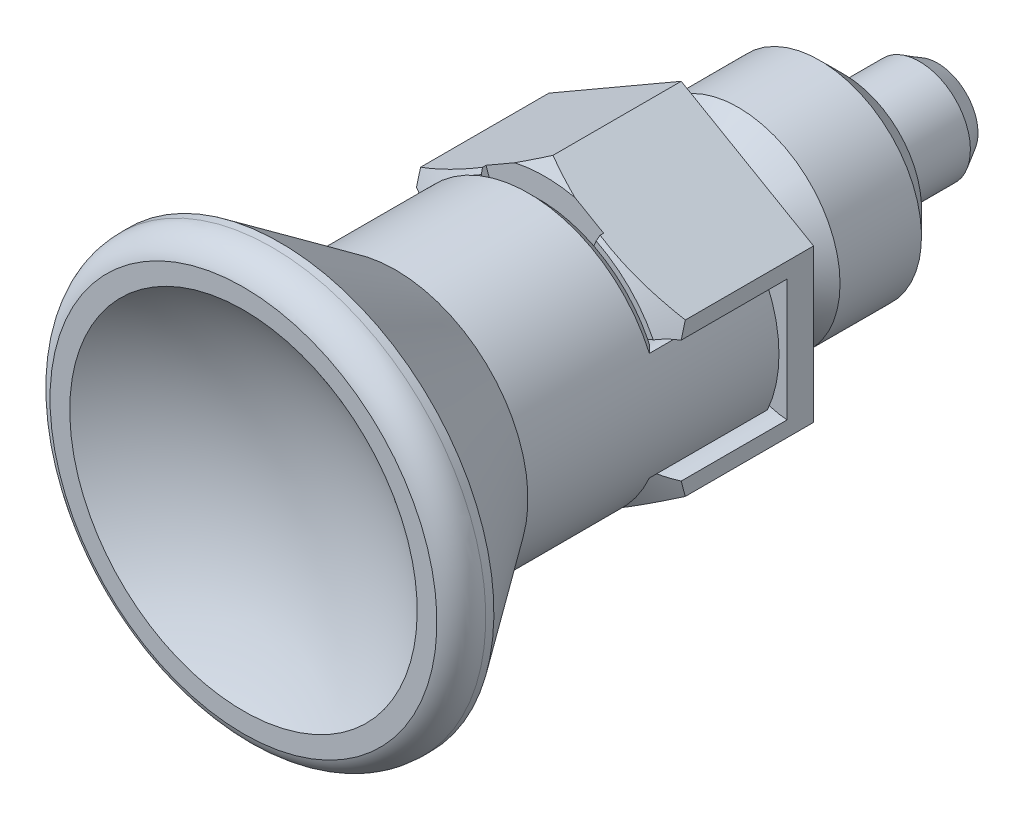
ISO-10303-21;
HEADER;
FILE_DESCRIPTION(('STEP AP214'),'2;1');
FILE_NAME('part.step','',(''),(''),'','','');
FILE_SCHEMA(('AUTOMOTIVE_DESIGN { 1 0 10303 214 1 1 1 1 }'));
ENDSEC;
DATA;
#1=APPLICATION_CONTEXT('core data for automotive mechanical design processes');
#2=APPLICATION_PROTOCOL_DEFINITION('international standard','automotive_design',2000,#1);
#3=PRODUCT_CONTEXT('',#1,'mechanical');
#4=PRODUCT('Part','Part','',(#3));
#5=PRODUCT_RELATED_PRODUCT_CATEGORY('part','',(#4));
#6=PRODUCT_DEFINITION_FORMATION('','',#4);
#7=PRODUCT_DEFINITION_CONTEXT('part definition',#1,'design');
#8=PRODUCT_DEFINITION('design','',#6,#7);
#9=PRODUCT_DEFINITION_SHAPE('','',#8);
#10=(LENGTH_UNIT() NAMED_UNIT(*) SI_UNIT(.MILLI.,.METRE.));
#11=(NAMED_UNIT(*) PLANE_ANGLE_UNIT() SI_UNIT($,.RADIAN.));
#12=(NAMED_UNIT(*) SI_UNIT($,.STERADIAN.) SOLID_ANGLE_UNIT());
#13=UNCERTAINTY_MEASURE_WITH_UNIT(LENGTH_MEASURE(1.E-05),#10,'distance_accuracy_value','');
#14=(GEOMETRIC_REPRESENTATION_CONTEXT(3) GLOBAL_UNCERTAINTY_ASSIGNED_CONTEXT((#13)) GLOBAL_UNIT_ASSIGNED_CONTEXT((#10,
#11,#12)) REPRESENTATION_CONTEXT('',''));
#15=CARTESIAN_POINT('',(0.,0.,0.));
#16=DIRECTION('',(0.,0.,1.));
#17=DIRECTION('',(1.,0.,0.));
#18=AXIS2_PLACEMENT_3D('',#15,#16,#17);
#19=CARTESIAN_POINT('',(0.,0.,-8.0000000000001));
#20=DIRECTION('',(-1.,0.,0.));
#21=DIRECTION('',(0.,1.,0.));
#22=AXIS2_PLACEMENT_3D('',#19,#20,#21);
#23=SPHERICAL_SURFACE('',#22,4.99999999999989);
#24=CARTESIAN_POINT('',(0.,0.,-12.5881225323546));
#25=DIRECTION('',(0.,0.,1.));
#26=DIRECTION('',(0.,-1.,0.));
#27=AXIS2_PLACEMENT_3D('',#24,#25,#26);
#28=CIRCLE('',#27,1.98724221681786);
#29=CARTESIAN_POINT('',(0.,-1.98724221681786,-12.5881225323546));
#30=VERTEX_POINT('',#29);
#31=EDGE_CURVE('E18',#30,#30,#28,.T.);
#32=ORIENTED_EDGE('',*,*,#31,.F.);
#33=EDGE_LOOP('',(#32));
#34=FACE_BOUND('',#33,.T.);
#35=ADVANCED_FACE('F14',(#34),#23,.T.);
#36=CARTESIAN_POINT('',(0.,0.,-11.7000000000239));
#37=DIRECTION('',(0.,0.,1.));
#38=DIRECTION('',(0.,-1.,0.));
#39=AXIS2_PLACEMENT_3D('',#36,#37,#38);
#40=CONICAL_SURFACE('',#39,2.49999999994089,0.523598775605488);
#41=CARTESIAN_POINT('',(0.,0.,-11.7));
#42=DIRECTION('',(0.,0.,1.));
#43=DIRECTION('',(0.,-1.,0.));
#44=AXIS2_PLACEMENT_3D('',#41,#42,#43);
#45=CIRCLE('',#44,2.5);
#46=CARTESIAN_POINT('',(0.,-2.5,-11.7));
#47=VERTEX_POINT('',#46);
#48=EDGE_CURVE('E890',#47,#47,#45,.T.);
#49=ORIENTED_EDGE('',*,*,#48,.F.);
#50=EDGE_LOOP('',(#49));
#51=FACE_BOUND('',#50,.T.);
#52=ORIENTED_EDGE('',*,*,#31,.T.);
#53=EDGE_LOOP('',(#52));
#54=FACE_BOUND('',#53,.T.);
#55=ADVANCED_FACE('F879',(#51,#54),#40,.T.);
#56=CARTESIAN_POINT('',(0.,0.,-13.));
#57=DIRECTION('',(0.,0.,1.));
#58=DIRECTION('',(0.,-1.,0.));
#59=AXIS2_PLACEMENT_3D('',#56,#57,#58);
#60=CYLINDRICAL_SURFACE('',#59,2.5);
#61=CARTESIAN_POINT('',(0.,0.,-8.));
#62=DIRECTION('',(0.,0.,1.));
#63=DIRECTION('',(0.,-1.,0.));
#64=AXIS2_PLACEMENT_3D('',#61,#62,#63);
#65=CIRCLE('',#64,2.5);
#66=CARTESIAN_POINT('',(0.,-2.5,-8.));
#67=VERTEX_POINT('',#66);
#68=EDGE_CURVE('E893',#67,#67,#65,.F.);
#69=ORIENTED_EDGE('',*,*,#68,.T.);
#70=EDGE_LOOP('',(#69));
#71=FACE_BOUND('',#70,.T.);
#72=ORIENTED_EDGE('',*,*,#48,.T.);
#73=EDGE_LOOP('',(#72));
#74=FACE_BOUND('',#73,.T.);
#75=ADVANCED_FACE('F876',(#71,#74),#60,.T.);
#76=CARTESIAN_POINT('',(3.8,0.,-8.));
#77=DIRECTION('',(0.,0.,1.));
#78=DIRECTION('',(0.,-1.,0.));
#79=AXIS2_PLACEMENT_3D('',#76,#77,#78);
#80=PLANE('',#79);
#81=CARTESIAN_POINT('',(0.,0.,-8.0000000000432));
#82=DIRECTION('',(0.,0.,1.));
#83=DIRECTION('',(-1.,0.,0.));
#84=AXIS2_PLACEMENT_3D('',#81,#82,#83);
#85=CIRCLE('',#84,3.79999999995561);
#86=CARTESIAN_POINT('',(-3.79999999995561,0.,-8.0000000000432));
#87=VERTEX_POINT('',#86);
#88=EDGE_CURVE('E897',#87,#87,#85,.T.);
#89=ORIENTED_EDGE('',*,*,#88,.F.);
#90=EDGE_LOOP('',(#89));
#91=FACE_BOUND('',#90,.T.);
#92=ORIENTED_EDGE('',*,*,#68,.F.);
#93=EDGE_LOOP('',(#92));
#94=FACE_BOUND('',#93,.T.);
#95=ADVANCED_FACE('F872',(#91,#94),#80,.F.);
#96=CARTESIAN_POINT('',(0.,0.,-6.80000000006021));
#97=DIRECTION('',(0.,0.,1.));
#98=DIRECTION('',(-1.,0.,0.));
#99=AXIS2_PLACEMENT_3D('',#96,#97,#98);
#100=CONICAL_SURFACE('',#99,4.99999999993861,0.785398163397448);
#101=CARTESIAN_POINT('',(0.,0.,-6.8));
#102=DIRECTION('',(0.,0.,1.));
#103=DIRECTION('',(0.,-1.,0.));
#104=AXIS2_PLACEMENT_3D('',#101,#102,#103);
#105=CIRCLE('',#104,5.);
#106=CARTESIAN_POINT('',(0.,-5.,-6.8));
#107=VERTEX_POINT('',#106);
#108=EDGE_CURVE('E922',#107,#107,#105,.T.);
#109=ORIENTED_EDGE('',*,*,#108,.F.);
#110=EDGE_LOOP('',(#109));
#111=FACE_BOUND('',#110,.T.);
#112=ORIENTED_EDGE('',*,*,#88,.T.);
#113=EDGE_LOOP('',(#112));
#114=FACE_BOUND('',#113,.T.);
#115=ADVANCED_FACE('F868',(#111,#114),#100,.T.);
#116=CARTESIAN_POINT('',(0.,0.,-8.));
#117=DIRECTION('',(0.,0.,1.));
#118=DIRECTION('',(0.,-1.,0.));
#119=AXIS2_PLACEMENT_3D('',#116,#117,#118);
#120=CYLINDRICAL_SURFACE('',#119,5.);
#121=CARTESIAN_POINT('',(0.,0.,-2.79999999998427));
#122=DIRECTION('',(0.,0.,-1.));
#123=DIRECTION('',(0.,1.,0.));
#124=AXIS2_PLACEMENT_3D('',#121,#122,#123);
#125=CIRCLE('',#124,4.99999999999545);
#126=CARTESIAN_POINT('',(0.,4.99999999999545,-2.79999999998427));
#127=VERTEX_POINT('',#126);
#128=EDGE_CURVE('E925',#127,#127,#125,.F.);
#129=ORIENTED_EDGE('',*,*,#128,.F.);
#130=EDGE_LOOP('',(#129));
#131=FACE_BOUND('',#130,.T.);
#132=ORIENTED_EDGE('',*,*,#108,.T.);
#133=EDGE_LOOP('',(#132));
#134=FACE_BOUND('',#133,.T.);
#135=ADVANCED_FACE('F864',(#131,#134),#120,.T.);
#136=CARTESIAN_POINT('',(0.,0.,-2.79999999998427));
#137=DIRECTION('',(0.,0.,-1.));
#138=DIRECTION('',(0.,1.,0.));
#139=AXIS2_PLACEMENT_3D('',#136,#137,#138);
#140=CONICAL_SURFACE('',#139,4.99999999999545,0.698131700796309);
#141=CARTESIAN_POINT('',(0.,0.,-1.29883539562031));
#142=DIRECTION('',(0.,0.,-1.));
#143=DIRECTION('',(0.,1.,0.));
#144=AXIS2_PLACEMENT_3D('',#141,#142,#143);
#145=CIRCLE('',#144,3.74037333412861);
#146=CARTESIAN_POINT('',(0.,3.74037333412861,-1.29883539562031));
#147=VERTEX_POINT('',#146);
#148=EDGE_CURVE('E851',#147,#147,#145,.T.);
#149=ORIENTED_EDGE('',*,*,#148,.T.);
#150=EDGE_LOOP('',(#149));
#151=FACE_BOUND('',#150,.T.);
#152=ORIENTED_EDGE('',*,*,#128,.T.);
#153=EDGE_LOOP('',(#152));
#154=FACE_BOUND('',#153,.T.);
#155=ADVANCED_FACE('F860',(#151,#154),#140,.T.);
#156=CARTESIAN_POINT('',(0.,0.,-0.91316282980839));
#157=DIRECTION('',(0.,0.,-1.));
#158=DIRECTION('',(0.,1.,0.));
#159=AXIS2_PLACEMENT_3D('',#156,#157,#158);
#160=TOROIDAL_SURFACE('',#159,4.2,0.6);
#161=CARTESIAN_POINT('',(0.,0.,-0.91316282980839));
#162=DIRECTION('',(0.,0.,1.));
#163=DIRECTION('',(0.,-1.,0.));
#164=AXIS2_PLACEMENT_3D('',#161,#162,#163);
#165=CIRCLE('',#164,3.6);
#166=CARTESIAN_POINT('',(0.,-3.6,-0.91316282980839));
#167=VERTEX_POINT('',#166);
#168=EDGE_CURVE('E843',#167,#167,#165,.T.);
#169=ORIENTED_EDGE('',*,*,#168,.F.);
#170=EDGE_LOOP('',(#169));
#171=FACE_BOUND('',#170,.T.);
#172=ORIENTED_EDGE('',*,*,#148,.F.);
#173=EDGE_LOOP('',(#172));
#174=FACE_BOUND('',#173,.T.);
#175=ADVANCED_FACE('F857',(#171,#174),#160,.F.);
#176=CARTESIAN_POINT('',(0.,0.,-8.));
#177=DIRECTION('',(0.,0.,1.));
#178=DIRECTION('',(0.,-1.,0.));
#179=AXIS2_PLACEMENT_3D('',#176,#177,#178);
#180=CYLINDRICAL_SURFACE('',#179,3.6);
#181=CARTESIAN_POINT('',(0.,0.,-0.6));
#182=DIRECTION('',(0.,0.,-1.));
#183=DIRECTION('',(0.,1.,0.));
#184=AXIS2_PLACEMENT_3D('',#181,#182,#183);
#185=CIRCLE('',#184,3.6);
#186=CARTESIAN_POINT('',(0.,3.6,-0.6));
#187=VERTEX_POINT('',#186);
#188=EDGE_CURVE('E829',#187,#187,#185,.T.);
#189=ORIENTED_EDGE('',*,*,#188,.T.);
#190=EDGE_LOOP('',(#189));
#191=FACE_BOUND('',#190,.T.);
#192=ORIENTED_EDGE('',*,*,#168,.T.);
#193=EDGE_LOOP('',(#192));
#194=FACE_BOUND('',#193,.T.);
#195=ADVANCED_FACE('F835',(#191,#194),#180,.T.);
#196=CARTESIAN_POINT('',(0.,0.,-0.6));
#197=DIRECTION('',(0.,0.,-1.));
#198=DIRECTION('',(0.,1.,0.));
#199=AXIS2_PLACEMENT_3D('',#196,#197,#198);
#200=TOROIDAL_SURFACE('',#199,4.2,0.6);
#201=CARTESIAN_POINT('',(0.,0.,0.));
#202=DIRECTION('',(0.,0.,-1.));
#203=DIRECTION('',(0.,1.,0.));
#204=AXIS2_PLACEMENT_3D('',#201,#202,#203);
#205=CIRCLE('',#204,4.2);
#206=CARTESIAN_POINT('',(0.,4.2,0.));
#207=VERTEX_POINT('',#206);
#208=EDGE_CURVE('E276',#207,#207,#205,.T.);
#209=ORIENTED_EDGE('',*,*,#208,.T.);
#210=EDGE_LOOP('',(#209));
#211=FACE_BOUND('',#210,.T.);
#212=ORIENTED_EDGE('',*,*,#188,.F.);
#213=EDGE_LOOP('',(#212));
#214=FACE_BOUND('',#213,.T.);
#215=ADVANCED_FACE('F831',(#211,#214),#200,.F.);
#216=CARTESIAN_POINT('',(0.,0.,6.29760000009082));
#217=DIRECTION('',(0.,0.,-1.));
#218=DIRECTION('',(0.,1.,0.));
#219=AXIS2_PLACEMENT_3D('',#216,#217,#218);
#220=CONICAL_SURFACE('',#219,7.50971042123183,1.0471975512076);
#221=CARTESIAN_POINT('',(1.90229830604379E-12,7.50555349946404,6.2999999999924));
#222=CARTESIAN_POINT('',(0.122023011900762,7.4351034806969,6.34067158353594));
#223=CARTESIAN_POINT('',(0.244448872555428,7.36442087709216,6.37976491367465));
#224=CARTESIAN_POINT('',(0.490012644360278,7.22264456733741,6.4543870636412));
#225=CARTESIAN_POINT('',(0.613149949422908,7.15155121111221,6.48991854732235));
#226=CARTESIAN_POINT('',(0.860240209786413,7.00889358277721,6.55707506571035));
#227=CARTESIAN_POINT('',(0.984193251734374,6.93732926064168,6.58869967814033));
#228=CARTESIAN_POINT('',(1.23295638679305,6.7937057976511,6.64766860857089));
#229=CARTESIAN_POINT('',(1.35776705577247,6.7216463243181,6.67500968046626));
#230=CARTESIAN_POINT('',(1.48294029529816,6.6493775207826,6.69999999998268));
#231=B_SPLINE_CURVE_WITH_KNOTS('',3,(#221,#222,#223,#224,#225,#226,#227,#228,#229,#230),
.UNSPECIFIED.,.F.,.F.,(4,2,2,2,4),(0.,0.439962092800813,0.879592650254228,1.31927068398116,
1.75928031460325),.UNSPECIFIED.);
#232=CARTESIAN_POINT('',(9.51063329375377E-13,7.50555349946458,6.29999999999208));
#233=VERTEX_POINT('',#232);
#234=CARTESIAN_POINT('',(1.48294029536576,6.64937752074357,6.69999999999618));
#235=VERTEX_POINT('',#234);
#236=EDGE_CURVE('E197',#233,#235,#231,.T.);
#237=ORIENTED_EDGE('',*,*,#236,.F.);
#238=CARTESIAN_POINT('',(-1.48294029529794,6.64937752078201,6.69999999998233));
#239=CARTESIAN_POINT('',(-1.3577670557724,6.72164632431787,6.67500968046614));
#240=CARTESIAN_POINT('',(-1.23295638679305,6.79370579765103,6.64766860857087));
#241=CARTESIAN_POINT('',(-0.984193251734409,6.93732926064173,6.58869967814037));
#242=CARTESIAN_POINT('',(-0.860240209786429,7.00889358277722,6.55707506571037));
#243=CARTESIAN_POINT('',(-0.613149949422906,7.15155121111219,6.48991854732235));
#244=CARTESIAN_POINT('',(-0.49001264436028,7.22264456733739,6.4543870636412));
#245=CARTESIAN_POINT('',(-0.244448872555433,7.36442087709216,6.37976491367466));
#246=CARTESIAN_POINT('',(-0.122023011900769,7.43510348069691,6.34067158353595));
#247=CARTESIAN_POINT('',(-1.89964508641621E-12,7.50555349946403,6.2999999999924));
#248=B_SPLINE_CURVE_WITH_KNOTS('',3,(#238,#239,#240,#241,#242,#243,#244,#245,#246,#247),
.UNSPECIFIED.,.F.,.F.,(4,2,2,2,4),(0.,0.440009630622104,0.879687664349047,1.31931822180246,
1.75928031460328),.UNSPECIFIED.);
#249=CARTESIAN_POINT('',(-1.48294029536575,6.64937752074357,6.69999999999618));
#250=VERTEX_POINT('',#249);
#251=EDGE_CURVE('E261',#250,#233,#248,.T.);
#252=ORIENTED_EDGE('',*,*,#251,.F.);
#253=CARTESIAN_POINT('',(0.,0.,6.70000000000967));
#254=DIRECTION('',(0.,0.,-1.));
#255=DIRECTION('',(0.,1.,0.));
#256=AXIS2_PLACEMENT_3D('',#253,#254,#255);
#257=CIRCLE('',#256,6.81273317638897);
#258=EDGE_CURVE('E265',#235,#250,#257,.F.);
#259=ORIENTED_EDGE('',*,*,#258,.F.);
#260=EDGE_LOOP('',(#237,#252,#259));
#261=FACE_BOUND('',#260,.T.);
#262=ADVANCED_FACE('F306',(#261),#220,.T.);
#263=CARTESIAN_POINT('',(0.,0.,6.29760000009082));
#264=DIRECTION('',(0.,0.,-1.));
#265=DIRECTION('',(0.,1.,0.));
#266=AXIS2_PLACEMENT_3D('',#263,#264,#265);
#267=CONICAL_SURFACE('',#266,7.50971042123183,1.0471975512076);
#268=CARTESIAN_POINT('',(-1.9096657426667E-12,-7.50555349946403,6.2999999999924));
#269=CARTESIAN_POINT('',(-0.12202301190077,-7.4351034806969,6.34067158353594));
#270=CARTESIAN_POINT('',(-0.244448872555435,-7.36442087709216,6.37976491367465));
#271=CARTESIAN_POINT('',(-0.490012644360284,-7.22264456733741,6.4543870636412));
#272=CARTESIAN_POINT('',(-0.613149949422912,-7.15155121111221,6.48991854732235));
#273=CARTESIAN_POINT('',(-0.860240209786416,-7.00889358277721,6.55707506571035));
#274=CARTESIAN_POINT('',(-0.984193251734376,-6.93732926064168,6.58869967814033));
#275=CARTESIAN_POINT('',(-1.23295638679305,-6.7937057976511,6.64766860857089));
#276=CARTESIAN_POINT('',(-1.35776705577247,-6.7216463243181,6.67500968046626));
#277=CARTESIAN_POINT('',(-1.48294029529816,-6.6493775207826,6.69999999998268));
#278=B_SPLINE_CURVE_WITH_KNOTS('',3,(#268,#269,#270,#271,#272,#273,#274,#275,#276,#277),
.UNSPECIFIED.,.F.,.F.,(4,2,2,2,4),(0.,0.43996209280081,0.879592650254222,1.31927068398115,
1.75928031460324),.UNSPECIFIED.);
#279=CARTESIAN_POINT('',(-9.59645241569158E-13,-7.50555349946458,6.29999999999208));
#280=VERTEX_POINT('',#279);
#281=CARTESIAN_POINT('',(-1.48294029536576,-6.64937752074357,6.69999999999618));
#282=VERTEX_POINT('',#281);
#283=EDGE_CURVE('E241',#280,#282,#278,.T.);
#284=ORIENTED_EDGE('',*,*,#283,.F.);
#285=CARTESIAN_POINT('',(1.48294029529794,-6.64937752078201,6.69999999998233));
#286=CARTESIAN_POINT('',(1.3577670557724,-6.72164632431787,6.67500968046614));
#287=CARTESIAN_POINT('',(1.23295638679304,-6.79370579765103,6.64766860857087));
#288=CARTESIAN_POINT('',(0.984193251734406,-6.93732926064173,6.58869967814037));
#289=CARTESIAN_POINT('',(0.860240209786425,-7.00889358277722,6.55707506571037));
#290=CARTESIAN_POINT('',(0.6131499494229,-7.15155121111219,6.48991854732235));
#291=CARTESIAN_POINT('',(0.490012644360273,-7.2226445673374,6.4543870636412));
#292=CARTESIAN_POINT('',(0.244448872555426,-7.36442087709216,6.37976491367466));
#293=CARTESIAN_POINT('',(0.122023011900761,-7.43510348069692,6.34067158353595));
#294=CARTESIAN_POINT('',(1.89232224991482E-12,-7.50555349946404,6.2999999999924));
#295=B_SPLINE_CURVE_WITH_KNOTS('',3,(#285,#286,#287,#288,#289,#290,#291,#292,#293,#294),
.UNSPECIFIED.,.F.,.F.,(4,2,2,2,4),(0.,0.440009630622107,0.879687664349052,1.31931822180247,
1.75928031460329),.UNSPECIFIED.);
#296=CARTESIAN_POINT('',(1.48294029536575,-6.64937752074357,6.69999999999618));
#297=VERTEX_POINT('',#296);
#298=EDGE_CURVE('E312',#297,#280,#295,.T.);
#299=ORIENTED_EDGE('',*,*,#298,.F.);
#300=CARTESIAN_POINT('',(0.,0.,6.70000000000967));
#301=DIRECTION('',(0.,0.,-1.));
#302=DIRECTION('',(0.,1.,0.));
#303=AXIS2_PLACEMENT_3D('',#300,#301,#302);
#304=CIRCLE('',#303,6.81273317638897);
#305=EDGE_CURVE('E327',#282,#297,#304,.F.);
#306=ORIENTED_EDGE('',*,*,#305,.F.);
#307=EDGE_LOOP('',(#284,#299,#306));
#308=FACE_BOUND('',#307,.T.);
#309=ADVANCED_FACE('F300',(#308),#267,.T.);
#310=CARTESIAN_POINT('',(18.,0.,0.));
#311=DIRECTION('',(0.,0.,1.));
#312=DIRECTION('',(0.,-1.,0.));
#313=AXIS2_PLACEMENT_3D('',#310,#311,#312);
#314=PLANE('',#313);
#315=DIRECTION('',(-0.866025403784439,0.5,0.));
#316=VECTOR('',#315,1.);
#317=CARTESIAN_POINT('',(6.5,3.75277674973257,0.));
#318=LINE('',#317,#316);
#319=CARTESIAN_POINT('',(6.5,3.75277674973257,0.));
#320=VERTEX_POINT('',#319);
#321=CARTESIAN_POINT('',(0.,7.50555349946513,0.));
#322=VERTEX_POINT('',#321);
#323=EDGE_CURVE('E205',#320,#322,#318,.T.);
#324=ORIENTED_EDGE('',*,*,#323,.F.);
#325=DIRECTION('',(0.,1.,0.));
#326=VECTOR('',#325,1.);
#327=CARTESIAN_POINT('',(6.5,-3.75277674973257,0.));
#328=LINE('',#327,#326);
#329=CARTESIAN_POINT('',(6.5,-3.75277674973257,0.));
#330=VERTEX_POINT('',#329);
#331=EDGE_CURVE('E278',#330,#320,#328,.T.);
#332=ORIENTED_EDGE('',*,*,#331,.F.);
#333=DIRECTION('',(0.866025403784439,0.5,0.));
#334=VECTOR('',#333,1.);
#335=CARTESIAN_POINT('',(0.,-7.50555349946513,0.));
#336=LINE('',#335,#334);
#337=CARTESIAN_POINT('',(0.,-7.50555349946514,0.));
#338=VERTEX_POINT('',#337);
#339=EDGE_CURVE('E218',#338,#330,#336,.T.);
#340=ORIENTED_EDGE('',*,*,#339,.F.);
#341=DIRECTION('',(0.866025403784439,-0.5,0.));
#342=VECTOR('',#341,1.);
#343=CARTESIAN_POINT('',(-6.5,-3.75277674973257,0.));
#344=LINE('',#343,#342);
#345=CARTESIAN_POINT('',(-6.5,-3.75277674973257,0.));
#346=VERTEX_POINT('',#345);
#347=EDGE_CURVE('E236',#346,#338,#344,.T.);
#348=ORIENTED_EDGE('',*,*,#347,.F.);
#349=DIRECTION('',(0.,-1.,0.));
#350=VECTOR('',#349,1.);
#351=CARTESIAN_POINT('',(-6.5,3.75277674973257,0.));
#352=LINE('',#351,#350);
#353=CARTESIAN_POINT('',(-6.5,3.75277674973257,0.));
#354=VERTEX_POINT('',#353);
#355=EDGE_CURVE('E226',#354,#346,#352,.T.);
#356=ORIENTED_EDGE('',*,*,#355,.F.);
#357=DIRECTION('',(-0.866025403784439,-0.5,0.));
#358=VECTOR('',#357,1.);
#359=CARTESIAN_POINT('',(0.,7.50555349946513,0.));
#360=LINE('',#359,#358);
#361=EDGE_CURVE('E257',#322,#354,#360,.T.);
#362=ORIENTED_EDGE('',*,*,#361,.F.);
#363=EDGE_LOOP('',(#324,#332,#340,#348,#356,#362));
#364=FACE_BOUND('',#363,.T.);
#365=ORIENTED_EDGE('',*,*,#208,.F.);
#366=EDGE_LOOP('',(#365));
#367=FACE_BOUND('',#366,.T.);
#368=ADVANCED_FACE('F237',(#364,#367),#314,.F.);
#369=CARTESIAN_POINT('',(6.5,3.75277674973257,0.));
#370=DIRECTION('',(0.5,0.866025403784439,0.));
#371=DIRECTION('',(-0.866025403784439,0.5,0.));
#372=AXIS2_PLACEMENT_3D('',#369,#370,#371);
#373=PLANE('',#372);
#374=ORIENTED_EDGE('',*,*,#236,.T.);
#375=DIRECTION('',(-0.866025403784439,0.5,0.));
#376=VECTOR('',#375,1.);
#377=CARTESIAN_POINT('',(2.88805681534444,5.83813311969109,6.7));
#378=LINE('',#377,#376);
#379=CARTESIAN_POINT('',(2.88805681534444,5.83813311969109,6.7));
#380=VERTEX_POINT('',#379);
#381=EDGE_CURVE('E271',#380,#235,#378,.T.);
#382=ORIENTED_EDGE('',*,*,#381,.F.);
#383=DIRECTION('',(0.,0.,1.));
#384=VECTOR('',#383,1.);
#385=CARTESIAN_POINT('',(2.88805681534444,5.83813311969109,0.));
#386=LINE('',#385,#384);
#387=CARTESIAN_POINT('',(2.88805681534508,5.83813311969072,6.87280719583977));
#388=VERTEX_POINT('',#387);
#389=EDGE_CURVE('E274',#380,#388,#386,.T.);
#390=ORIENTED_EDGE('',*,*,#389,.T.);
#391=CARTESIAN_POINT('',(6.5000000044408,3.75277670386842,6.29999996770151));
#392=CARTESIAN_POINT('',(6.35307591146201,3.83760339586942,6.34896446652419));
#393=CARTESIAN_POINT('',(6.20558811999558,3.92275552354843,6.39564457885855));
#394=CARTESIAN_POINT('',(5.90937896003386,4.09377197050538,6.48378693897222));
#395=CARTESIAN_POINT('',(5.76065705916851,4.17963659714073,6.52524679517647));
#396=CARTESIAN_POINT('',(5.31473907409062,4.43708746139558,6.64022683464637));
#397=CARTESIAN_POINT('',(5.01576754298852,4.6096987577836,6.7050399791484));
#398=CARTESIAN_POINT('',(4.56442607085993,4.87028087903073,6.78083548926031));
#399=CARTESIAN_POINT('',(4.41337001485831,4.95749313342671,6.80253916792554));
#400=CARTESIAN_POINT('',(4.11056588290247,5.13231718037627,6.83825584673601));
#401=CARTESIAN_POINT('',(3.95881781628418,5.21992896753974,6.85226895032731));
#402=CARTESIAN_POINT('',(3.6539332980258,5.39595412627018,6.87227261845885));
#403=CARTESIAN_POINT('',(3.5007942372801,5.48436900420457,6.87821038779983));
#404=CARTESIAN_POINT('',(3.19441213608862,5.66125879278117,6.88177464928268));
#405=CARTESIAN_POINT('',(3.04116908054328,5.74973371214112,6.87939939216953));
#406=CARTESIAN_POINT('',(2.88805681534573,5.83813311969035,6.8728071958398));
#407=B_SPLINE_CURVE_WITH_KNOTS('',3,(#391,#392,#393,#394,#395,#396,#397,#398,#399,#400,#401,
#402,#403,#404,#405,#406),.UNSPECIFIED.,.F.,.F.,(4,2,2,2,2,2,2,4),(0.,0.529690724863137,
1.05962324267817,2.11219091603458,2.63936184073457,3.16652567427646,3.69711971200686,
4.22782540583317),.UNSPECIFIED.);
#408=CARTESIAN_POINT('',(6.50000001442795,3.75277674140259,6.29999999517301));
#409=VERTEX_POINT('',#408);
#410=EDGE_CURVE('E415',#409,#388,#407,.T.);
#411=ORIENTED_EDGE('',*,*,#410,.F.);
#412=DIRECTION('',(0.,0.,1.));
#413=VECTOR('',#412,1.);
#414=CARTESIAN_POINT('',(6.5,3.75277674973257,0.));
#415=LINE('',#414,#413);
#416=EDGE_CURVE('E281',#320,#409,#415,.T.);
#417=ORIENTED_EDGE('',*,*,#416,.F.);
#418=ORIENTED_EDGE('',*,*,#323,.T.);
#419=DIRECTION('',(0.,0.,1.));
#420=VECTOR('',#419,1.);
#421=CARTESIAN_POINT('',(0.,7.50555349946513,0.));
#422=LINE('',#421,#420);
#423=EDGE_CURVE('E258',#233,#322,#422,.F.);
#424=ORIENTED_EDGE('',*,*,#423,.F.);
#425=EDGE_LOOP('',(#374,#382,#390,#411,#417,#418,#424));
#426=FACE_BOUND('',#425,.T.);
#427=ADVANCED_FACE('F299',(#426),#373,.T.);
#428=CARTESIAN_POINT('',(0.,0.,6.7));
#429=DIRECTION('',(0.,0.,1.));
#430=DIRECTION('',(0.,-1.,0.));
#431=AXIS2_PLACEMENT_3D('',#428,#429,#430);
#432=PLANE('',#431);
#433=ORIENTED_EDGE('',*,*,#258,.T.);
#434=DIRECTION('',(-0.866025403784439,-0.5,0.));
#435=VECTOR('',#434,1.);
#436=CARTESIAN_POINT('',(0.,7.50555349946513,6.7));
#437=LINE('',#436,#435);
#438=CARTESIAN_POINT('',(-2.88805681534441,5.83813311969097,6.7));
#439=VERTEX_POINT('',#438);
#440=EDGE_CURVE('E262',#439,#250,#437,.F.);
#441=ORIENTED_EDGE('',*,*,#440,.F.);
#442=CARTESIAN_POINT('',(0.,6.65,6.7));
#443=DIRECTION('',(0.,0.,-1.));
#444=DIRECTION('',(0.,1.,0.));
#445=AXIS2_PLACEMENT_3D('',#442,#443,#444);
#446=CIRCLE('',#445,3.);
#447=EDGE_CURVE('E422',#439,#380,#446,.F.);
#448=ORIENTED_EDGE('',*,*,#447,.T.);
#449=ORIENTED_EDGE('',*,*,#381,.T.);
#450=EDGE_LOOP('',(#433,#441,#448,#449));
#451=FACE_BOUND('',#450,.T.);
#452=ADVANCED_FACE('F954',(#451),#432,.T.);
#453=CARTESIAN_POINT('',(0.,7.50555349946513,0.));
#454=DIRECTION('',(-0.5,0.866025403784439,0.));
#455=DIRECTION('',(-0.866025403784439,-0.5,0.));
#456=AXIS2_PLACEMENT_3D('',#453,#454,#455);
#457=PLANE('',#456);
#458=DIRECTION('',(0.,0.,1.));
#459=VECTOR('',#458,1.);
#460=CARTESIAN_POINT('',(-6.5,3.75277674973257,0.));
#461=LINE('',#460,#459);
#462=CARTESIAN_POINT('',(-6.5,3.7527767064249,6.30000001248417));
#463=VERTEX_POINT('',#462);
#464=EDGE_CURVE('E233',#463,#354,#461,.F.);
#465=ORIENTED_EDGE('',*,*,#464,.F.);
#466=CARTESIAN_POINT('',(-2.88805683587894,5.83813305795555,6.87280717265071));
#467=CARTESIAN_POINT('',(-3.01648949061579,5.76398246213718,6.87832220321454));
#468=CARTESIAN_POINT('',(-3.14501539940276,5.6897780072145,6.88088759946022));
#469=CARTESIAN_POINT('',(-3.40204127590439,5.54138405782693,6.88016000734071));
#470=CARTESIAN_POINT('',(-3.53054124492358,5.46719456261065,6.87686764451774));
#471=CARTESIAN_POINT('',(-3.7871591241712,5.31903615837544,6.86447484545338));
#472=CARTESIAN_POINT('',(-3.9152773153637,5.24506708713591,6.85538215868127));
#473=CARTESIAN_POINT('',(-4.17111738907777,5.09735775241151,6.83158506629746));
#474=CARTESIAN_POINT('',(-4.29883926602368,5.02361749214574,6.81688058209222));
#475=CARTESIAN_POINT('',(-4.67883950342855,4.80422425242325,6.76505394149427));
#476=CARTESIAN_POINT('',(-4.93033545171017,4.65902299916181,6.72009402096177));
#477=CARTESIAN_POINT('',(-5.43033262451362,4.37034949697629,6.61198568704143));
#478=CARTESIAN_POINT('',(-5.67883356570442,4.22687741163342,6.54883556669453));
#479=CARTESIAN_POINT('',(-6.02180588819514,4.02886224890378,6.45067748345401));
#480=CARTESIAN_POINT('',(-6.11768027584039,3.97350914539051,6.42202975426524));
#481=CARTESIAN_POINT('',(-6.30911662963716,3.86298331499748,6.36257946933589));
#482=CARTESIAN_POINT('',(-6.40467769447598,3.80781110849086,6.33177303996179));
#483=CARTESIAN_POINT('',(-6.50000002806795,3.75277673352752,6.29999999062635));
#484=B_SPLINE_CURVE_WITH_KNOTS('',3,(#466,#467,#468,#469,#470,#471,#472,#473,#474,#475,#476,
#477,#478,#479,#480,#481,#482,#483),.UNSPECIFIED.,.F.,.F.,(4,2,2,2,2,2,2,2,4),(0.,
0.445178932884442,0.890310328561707,1.33484825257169,1.77939240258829,2.66023803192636,
3.54116634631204,3.88421014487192,4.22788610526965),.UNSPECIFIED.);
#485=CARTESIAN_POINT('',(-2.88805683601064,5.83813310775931,6.87280719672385));
#486=VERTEX_POINT('',#485);
#487=EDGE_CURVE('E447',#486,#463,#484,.T.);
#488=ORIENTED_EDGE('',*,*,#487,.F.);
#489=DIRECTION('',(0.,0.,-1.));
#490=VECTOR('',#489,1.);
#491=CARTESIAN_POINT('',(-2.88805681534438,5.83813311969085,6.7));
#492=LINE('',#491,#490);
#493=EDGE_CURVE('E266',#486,#439,#492,.T.);
#494=ORIENTED_EDGE('',*,*,#493,.T.);
#495=ORIENTED_EDGE('',*,*,#440,.T.);
#496=ORIENTED_EDGE('',*,*,#251,.T.);
#497=ORIENTED_EDGE('',*,*,#423,.T.);
#498=ORIENTED_EDGE('',*,*,#361,.T.);
#499=EDGE_LOOP('',(#465,#488,#494,#495,#496,#497,#498));
#500=FACE_BOUND('',#499,.T.);
#501=ADVANCED_FACE('F823',(#500),#457,.T.);
#502=CARTESIAN_POINT('',(0.,0.,1.3));
#503=DIRECTION('',(0.,0.,1.));
#504=DIRECTION('',(0.,-1.,0.));
#505=AXIS2_PLACEMENT_3D('',#502,#503,#504);
#506=PLANE('',#505);
#507=CARTESIAN_POINT('',(-6.65,0.,1.3));
#508=DIRECTION('',(0.,0.,-1.));
#509=DIRECTION('',(0.,1.,0.));
#510=AXIS2_PLACEMENT_3D('',#507,#508,#509);
#511=CIRCLE('',#510,3.);
#512=CARTESIAN_POINT('',(-6.5,-2.99624765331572,1.3));
#513=VERTEX_POINT('',#512);
#514=CARTESIAN_POINT('',(-6.5,2.99624765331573,1.3));
#515=VERTEX_POINT('',#514);
#516=EDGE_CURVE('E475',#513,#515,#511,.F.);
#517=ORIENTED_EDGE('',*,*,#516,.T.);
#518=DIRECTION('',(0.,-1.,0.));
#519=VECTOR('',#518,1.);
#520=CARTESIAN_POINT('',(-6.5,3.75277674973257,1.3));
#521=LINE('',#520,#519);
#522=EDGE_CURVE('E254',#513,#515,#521,.F.);
#523=ORIENTED_EDGE('',*,*,#522,.F.);
#524=EDGE_LOOP('',(#517,#523));
#525=FACE_BOUND('',#524,.T.);
#526=ADVANCED_FACE('F953',(#525),#506,.T.);
#527=CARTESIAN_POINT('',(-6.5,3.75277674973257,0.));
#528=DIRECTION('',(-1.,0.,0.));
#529=DIRECTION('',(0.,-1.,0.));
#530=AXIS2_PLACEMENT_3D('',#527,#528,#529);
#531=PLANE('',#530);
#532=DIRECTION('',(0.,0.,1.));
#533=VECTOR('',#532,1.);
#534=CARTESIAN_POINT('',(-6.5,-3.75277674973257,0.));
#535=LINE('',#534,#533);
#536=CARTESIAN_POINT('',(-6.5,-3.75277674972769,6.29999999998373));
#537=VERTEX_POINT('',#536);
#538=EDGE_CURVE('E230',#537,#346,#535,.F.);
#539=ORIENTED_EDGE('',*,*,#538,.F.);
#540=CARTESIAN_POINT('',(-6.49999999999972,-3.75277674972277,6.29999999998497));
#541=CARTESIAN_POINT('',(-6.4999999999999,-3.69009533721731,6.31809443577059));
#542=CARTESIAN_POINT('',(-6.49999999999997,-3.62732307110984,6.33587535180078));
#543=CARTESIAN_POINT('',(-6.50000000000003,-3.50160317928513,6.37077594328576));
#544=CARTESIAN_POINT('',(-6.50000000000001,-3.43865557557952,6.38789569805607));
#545=CARTESIAN_POINT('',(-6.49999999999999,-3.31257574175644,6.42144427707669));
#546=CARTESIAN_POINT('',(-6.5,-3.24944351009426,6.43787309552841));
#547=CARTESIAN_POINT('',(-6.5,-3.122987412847,6.47000825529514));
#548=CARTESIAN_POINT('',(-6.50000000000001,-3.05966352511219,6.48571450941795));
#549=CARTESIAN_POINT('',(-6.5,-2.9962476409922,6.50104180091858));
#550=B_SPLINE_CURVE_WITH_KNOTS('',3,(#540,#541,#542,#543,#544,#545,#546,#547,#548,#549),
.UNSPECIFIED.,.F.,.F.,(4,2,2,2,4),(0.,0.195722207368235,0.391420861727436,0.587121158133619,
0.782845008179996),.UNSPECIFIED.);
#551=CARTESIAN_POINT('',(-6.5,-2.99624764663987,6.50104179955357));
#552=VERTEX_POINT('',#551);
#553=EDGE_CURVE('E234',#537,#552,#550,.T.);
#554=ORIENTED_EDGE('',*,*,#553,.T.);
#555=DIRECTION('',(0.,0.,-1.));
#556=VECTOR('',#555,1.);
#557=CARTESIAN_POINT('',(-6.5,-2.99624765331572,1.3));
#558=LINE('',#557,#556);
#559=EDGE_CURVE('E481',#552,#513,#558,.T.);
#560=ORIENTED_EDGE('',*,*,#559,.T.);
#561=ORIENTED_EDGE('',*,*,#522,.T.);
#562=DIRECTION('',(0.,0.,-1.));
#563=VECTOR('',#562,1.);
#564=CARTESIAN_POINT('',(-6.5,2.99624765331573,1.3));
#565=LINE('',#564,#563);
#566=CARTESIAN_POINT('',(-6.5,2.99624766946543,6.50104179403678));
#567=VERTEX_POINT('',#566);
#568=EDGE_CURVE('E469',#515,#567,#565,.F.);
#569=ORIENTED_EDGE('',*,*,#568,.T.);
#570=CARTESIAN_POINT('',(-6.49999999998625,3.75277666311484,6.30000002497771));
#571=CARTESIAN_POINT('',(-6.49999999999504,3.69009526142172,6.31809445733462));
#572=CARTESIAN_POINT('',(-6.49999999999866,3.6273230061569,6.33587537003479));
#573=CARTESIAN_POINT('',(-6.50000000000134,3.50160313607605,6.37077595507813));
#574=CARTESIAN_POINT('',(-6.50000000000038,3.43865554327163,6.38789570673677));
#575=CARTESIAN_POINT('',(-6.49999999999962,3.31257573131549,6.42144427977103));
#576=CARTESIAN_POINT('',(-6.49999999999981,3.24944351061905,6.43787309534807));
#577=CARTESIAN_POINT('',(-6.50000000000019,3.12298743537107,6.47000824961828));
#578=CARTESIAN_POINT('',(-6.50000000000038,3.05966355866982,6.4857145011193));
#579=CARTESIAN_POINT('',(-6.5,2.99624768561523,6.50104179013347));
#580=B_SPLINE_CURVE_WITH_KNOTS('',3,(#570,#571,#572,#573,#574,#575,#576,#577,#578,#579),
.UNSPECIFIED.,.F.,.F.,(4,2,2,2,4),(0.,0.195722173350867,0.391420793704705,0.587121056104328,
0.782844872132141),.UNSPECIFIED.);
#581=EDGE_CURVE('E269',#463,#567,#580,.T.);
#582=ORIENTED_EDGE('',*,*,#581,.F.);
#583=ORIENTED_EDGE('',*,*,#464,.T.);
#584=ORIENTED_EDGE('',*,*,#355,.T.);
#585=EDGE_LOOP('',(#539,#554,#560,#561,#569,#582,#583,#584));
#586=FACE_BOUND('',#585,.T.);
#587=ADVANCED_FACE('F228',(#586),#531,.T.);
#588=CARTESIAN_POINT('',(-6.5,-3.75277674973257,0.));
#589=DIRECTION('',(-0.5,-0.866025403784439,0.));
#590=DIRECTION('',(0.866025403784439,-0.5,0.));
#591=AXIS2_PLACEMENT_3D('',#588,#589,#590);
#592=PLANE('',#591);
#593=ORIENTED_EDGE('',*,*,#283,.T.);
#594=DIRECTION('',(0.866025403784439,-0.5,0.));
#595=VECTOR('',#594,1.);
#596=CARTESIAN_POINT('',(-2.88805681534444,-5.83813311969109,6.7));
#597=LINE('',#596,#595);
#598=CARTESIAN_POINT('',(-2.88805681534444,-5.83813311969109,6.7));
#599=VERTEX_POINT('',#598);
#600=EDGE_CURVE('E250',#599,#282,#597,.T.);
#601=ORIENTED_EDGE('',*,*,#600,.F.);
#602=DIRECTION('',(0.,0.,1.));
#603=VECTOR('',#602,1.);
#604=CARTESIAN_POINT('',(-2.88805681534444,-5.83813311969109,0.));
#605=LINE('',#604,#603);
#606=CARTESIAN_POINT('',(-2.88805681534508,-5.83813311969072,6.87280719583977));
#607=VERTEX_POINT('',#606);
#608=EDGE_CURVE('E246',#599,#607,#605,.T.);
#609=ORIENTED_EDGE('',*,*,#608,.T.);
#610=CARTESIAN_POINT('',(-6.49999999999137,-3.75277674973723,6.29999999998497));
#611=CARTESIAN_POINT('',(-6.35307589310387,-3.83760342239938,6.34896448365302));
#612=CARTESIAN_POINT('',(-6.20558809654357,-3.92275554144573,6.39564458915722));
#613=CARTESIAN_POINT('',(-5.90937893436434,-4.09377198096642,6.48378694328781));
#614=CARTESIAN_POINT('',(-5.76065703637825,-4.17963660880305,6.5252468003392));
#615=CARTESIAN_POINT('',(-5.31473905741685,-4.43708747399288,6.64022684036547));
#616=CARTESIAN_POINT('',(-5.01576752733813,-4.60969876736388,6.7050399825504));
#617=CARTESIAN_POINT('',(-4.56442605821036,-4.87028088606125,6.78083549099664));
#618=CARTESIAN_POINT('',(-4.41337000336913,-4.95749313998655,6.802539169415));
#619=CARTESIAN_POINT('',(-4.11056587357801,-5.13231718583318,6.83825584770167));
#620=CARTESIAN_POINT('',(-3.95881780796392,-5.21992897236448,6.85226895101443));
#621=CARTESIAN_POINT('',(-3.65393329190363,-5.39595412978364,6.87227261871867));
#622=CARTESIAN_POINT('',(-3.50079423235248,-5.48436900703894,6.87821038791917));
#623=CARTESIAN_POINT('',(-3.19441213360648,-5.66125879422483,6.88177464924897));
#624=CARTESIAN_POINT('',(-3.04116907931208,-5.74973371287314,6.87939939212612));
#625=CARTESIAN_POINT('',(-2.88805681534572,-5.83813311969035,6.8728071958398));
#626=B_SPLINE_CURVE_WITH_KNOTS('',3,(#610,#611,#612,#613,#614,#615,#616,#617,#618,#619,#620,
#621,#622,#623,#624,#625),.UNSPECIFIED.,.F.,.F.,(4,2,2,2,2,2,2,4),(0.,0.529690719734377,
1.05962323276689,2.11219089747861,2.6393618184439,3.16652564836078,3.69711968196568,
4.22782537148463),.UNSPECIFIED.);
#627=EDGE_CURVE('E245',#537,#607,#626,.T.);
#628=ORIENTED_EDGE('',*,*,#627,.F.);
#629=ORIENTED_EDGE('',*,*,#538,.T.);
#630=ORIENTED_EDGE('',*,*,#347,.T.);
#631=DIRECTION('',(0.,0.,1.));
#632=VECTOR('',#631,1.);
#633=CARTESIAN_POINT('',(0.,-7.50555349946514,0.));
#634=LINE('',#633,#632);
#635=EDGE_CURVE('E494',#280,#338,#634,.F.);
#636=ORIENTED_EDGE('',*,*,#635,.F.);
#637=EDGE_LOOP('',(#593,#601,#609,#628,#629,#630,#636));
#638=FACE_BOUND('',#637,.T.);
#639=ADVANCED_FACE('F243',(#638),#592,.T.);
#640=CARTESIAN_POINT('',(0.,0.,6.7));
#641=DIRECTION('',(0.,0.,1.));
#642=DIRECTION('',(0.,-1.,0.));
#643=AXIS2_PLACEMENT_3D('',#640,#641,#642);
#644=PLANE('',#643);
#645=ORIENTED_EDGE('',*,*,#305,.T.);
#646=DIRECTION('',(0.866025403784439,0.5,0.));
#647=VECTOR('',#646,1.);
#648=CARTESIAN_POINT('',(0.,-7.50555349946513,6.7));
#649=LINE('',#648,#647);
#650=CARTESIAN_POINT('',(2.88805681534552,-5.83813311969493,6.7));
#651=VERTEX_POINT('',#650);
#652=EDGE_CURVE('E496',#651,#297,#649,.F.);
#653=ORIENTED_EDGE('',*,*,#652,.F.);
#654=CARTESIAN_POINT('',(0.,-6.65,6.7));
#655=DIRECTION('',(0.,0.,-1.));
#656=DIRECTION('',(0.,1.,0.));
#657=AXIS2_PLACEMENT_3D('',#654,#655,#656);
#658=CIRCLE('',#657,3.);
#659=EDGE_CURVE('E349',#651,#599,#658,.F.);
#660=ORIENTED_EDGE('',*,*,#659,.T.);
#661=ORIENTED_EDGE('',*,*,#600,.T.);
#662=EDGE_LOOP('',(#645,#653,#660,#661));
#663=FACE_BOUND('',#662,.T.);
#664=ADVANCED_FACE('F338',(#663),#644,.T.);
#665=CARTESIAN_POINT('',(0.,-7.50555349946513,0.));
#666=DIRECTION('',(0.5,-0.866025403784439,0.));
#667=DIRECTION('',(0.866025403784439,0.5,0.));
#668=AXIS2_PLACEMENT_3D('',#665,#666,#667);
#669=PLANE('',#668);
#670=DIRECTION('',(0.,0.,1.));
#671=VECTOR('',#670,1.);
#672=CARTESIAN_POINT('',(6.5,-3.75277674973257,0.));
#673=LINE('',#672,#671);
#674=CARTESIAN_POINT('',(6.5,-3.75277670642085,6.30000001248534));
#675=VERTEX_POINT('',#674);
#676=EDGE_CURVE('E282',#675,#330,#673,.F.);
#677=ORIENTED_EDGE('',*,*,#676,.F.);
#678=CARTESIAN_POINT('',(2.88805683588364,-5.83813305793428,6.87280717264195));
#679=CARTESIAN_POINT('',(3.01648949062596,-5.76398246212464,6.87832220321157));
#680=CARTESIAN_POINT('',(3.14501539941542,-5.6897780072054,6.8808875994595));
#681=CARTESIAN_POINT('',(3.40204127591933,-5.54138405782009,6.88016000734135));
#682=CARTESIAN_POINT('',(3.53054124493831,-5.46719456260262,6.8768676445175));
#683=CARTESIAN_POINT('',(3.78715912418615,-5.31903615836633,6.86447484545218));
#684=CARTESIAN_POINT('',(3.91527731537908,-5.2450670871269,6.85538215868));
#685=CARTESIAN_POINT('',(4.17111738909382,-5.09735775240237,6.83158506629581));
#686=CARTESIAN_POINT('',(4.29883926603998,-5.02361749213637,6.81688058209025));
#687=CARTESIAN_POINT('',(4.67883950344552,-4.80422425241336,6.76505394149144));
#688=CARTESIAN_POINT('',(4.93033545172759,-4.65902299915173,6.72009402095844));
#689=CARTESIAN_POINT('',(5.43033262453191,-4.37034949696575,6.61198568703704));
#690=CARTESIAN_POINT('',(5.67883356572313,-4.22687741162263,6.54883556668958));
#691=CARTESIAN_POINT('',(6.02180588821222,-4.02886224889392,6.45067748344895));
#692=CARTESIAN_POINT('',(6.11768027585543,-3.97350914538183,6.42202975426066));
#693=CARTESIAN_POINT('',(6.30911662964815,-3.86298331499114,6.36257946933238));
#694=CARTESIAN_POINT('',(6.40467769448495,-3.80781110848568,6.33177303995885));
#695=CARTESIAN_POINT('',(6.50000002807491,-3.7527767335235,6.29999999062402));
#696=B_SPLINE_CURVE_WITH_KNOTS('',3,(#678,#679,#680,#681,#682,#683,#684,#685,#686,#687,#688,
#689,#690,#691,#692,#693,#694,#695),.UNSPECIFIED.,.F.,.F.,(4,2,2,2,2,2,2,2,4),(0.,
0.445178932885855,0.890310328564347,1.33484825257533,1.779392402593,2.66023803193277,
3.54116634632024,3.88421014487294,4.22788610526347),.UNSPECIFIED.);
#697=CARTESIAN_POINT('',(2.88805683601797,-5.83813310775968,6.87280719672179));
#698=VERTEX_POINT('',#697);
#699=EDGE_CURVE('E504',#698,#675,#696,.T.);
#700=ORIENTED_EDGE('',*,*,#699,.F.);
#701=DIRECTION('',(0.,0.,-1.));
#702=VECTOR('',#701,1.);
#703=CARTESIAN_POINT('',(2.8880568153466,-5.83813311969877,6.7));
#704=LINE('',#703,#702);
#705=EDGE_CURVE('E380',#698,#651,#704,.T.);
#706=ORIENTED_EDGE('',*,*,#705,.T.);
#707=ORIENTED_EDGE('',*,*,#652,.T.);
#708=ORIENTED_EDGE('',*,*,#298,.T.);
#709=ORIENTED_EDGE('',*,*,#635,.T.);
#710=ORIENTED_EDGE('',*,*,#339,.T.);
#711=EDGE_LOOP('',(#677,#700,#706,#707,#708,#709,#710));
#712=FACE_BOUND('',#711,.T.);
#713=ADVANCED_FACE('F501',(#712),#669,.T.);
#714=CARTESIAN_POINT('',(0.,0.,1.3));
#715=DIRECTION('',(0.,0.,1.));
#716=DIRECTION('',(0.,-1.,0.));
#717=AXIS2_PLACEMENT_3D('',#714,#715,#716);
#718=PLANE('',#717);
#719=CARTESIAN_POINT('',(6.65,0.,1.3));
#720=DIRECTION('',(0.,0.,-1.));
#721=DIRECTION('',(0.,1.,0.));
#722=AXIS2_PLACEMENT_3D('',#719,#720,#721);
#723=CIRCLE('',#722,3.);
#724=CARTESIAN_POINT('',(6.5,2.99624765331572,1.3));
#725=VERTEX_POINT('',#724);
#726=CARTESIAN_POINT('',(6.5,-2.99624765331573,1.3));
#727=VERTEX_POINT('',#726);
#728=EDGE_CURVE('E553',#725,#727,#723,.F.);
#729=ORIENTED_EDGE('',*,*,#728,.T.);
#730=DIRECTION('',(0.,1.,0.));
#731=VECTOR('',#730,1.);
#732=CARTESIAN_POINT('',(6.5,-3.75277674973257,1.3));
#733=LINE('',#732,#731);
#734=EDGE_CURVE('E491',#725,#727,#733,.F.);
#735=ORIENTED_EDGE('',*,*,#734,.F.);
#736=EDGE_LOOP('',(#729,#735));
#737=FACE_BOUND('',#736,.T.);
#738=ADVANCED_FACE('F403',(#737),#718,.T.);
#739=CARTESIAN_POINT('',(6.5,-3.75277674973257,0.));
#740=DIRECTION('',(1.,0.,0.));
#741=DIRECTION('',(0.,1.,0.));
#742=AXIS2_PLACEMENT_3D('',#739,#740,#741);
#743=PLANE('',#742);
#744=ORIENTED_EDGE('',*,*,#416,.T.);
#745=CARTESIAN_POINT('',(6.5,2.99624765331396,6.50104179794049));
#746=CARTESIAN_POINT('',(6.5,3.05966352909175,6.48571450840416));
#747=CARTESIAN_POINT('',(6.5,3.12298740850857,6.47000825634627));
#748=CARTESIAN_POINT('',(6.5,3.2494434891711,6.43787310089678));
#749=CARTESIAN_POINT('',(6.5,3.31257571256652,6.42144428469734));
#750=CARTESIAN_POINT('',(6.5,3.43865552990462,6.3878957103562));
#751=CARTESIAN_POINT('',(6.5,3.50160312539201,6.37077595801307));
#752=CARTESIAN_POINT('',(6.5,3.62732300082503,6.33587537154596));
#753=CARTESIAN_POINT('',(6.5,3.69009525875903,6.31809445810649));
#754=CARTESIAN_POINT('',(6.5,3.75277666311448,6.30000002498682));
#755=B_SPLINE_CURVE_WITH_KNOTS('',3,(#745,#746,#747,#748,#749,#750,#751,#752,#753,#754),
.UNSPECIFIED.,.F.,.F.,(4,2,2,2,4),(0.,0.195723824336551,0.391424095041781,0.587122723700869,
0.78284490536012),.UNSPECIFIED.);
#756=CARTESIAN_POINT('',(6.49999999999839,2.99624765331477,6.50104179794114));
#757=VERTEX_POINT('',#756);
#758=EDGE_CURVE('E408',#757,#409,#755,.T.);
#759=ORIENTED_EDGE('',*,*,#758,.F.);
#760=DIRECTION('',(0.,0.,-1.));
#761=VECTOR('',#760,1.);
#762=CARTESIAN_POINT('',(6.5,2.99624765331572,1.3));
#763=LINE('',#762,#761);
#764=EDGE_CURVE('E555',#757,#725,#763,.T.);
#765=ORIENTED_EDGE('',*,*,#764,.T.);
#766=ORIENTED_EDGE('',*,*,#734,.T.);
#767=DIRECTION('',(0.,0.,-1.));
#768=VECTOR('',#767,1.);
#769=CARTESIAN_POINT('',(6.5,-2.99624765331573,1.3));
#770=LINE('',#769,#768);
#771=CARTESIAN_POINT('',(6.5,-2.99624766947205,6.50104179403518));
#772=VERTEX_POINT('',#771);
#773=EDGE_CURVE('E552',#727,#772,#770,.F.);
#774=ORIENTED_EDGE('',*,*,#773,.T.);
#775=CARTESIAN_POINT('',(6.49999999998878,-3.75277666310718,6.30000002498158));
#776=CARTESIAN_POINT('',(6.49999999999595,-3.69009526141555,6.31809445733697));
#777=CARTESIAN_POINT('',(6.49999999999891,-3.62732300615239,6.33587537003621));
#778=CARTESIAN_POINT('',(6.50000000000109,-3.501603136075,6.37077595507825));
#779=CARTESIAN_POINT('',(6.50000000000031,-3.4386555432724,6.38789570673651));
#780=CARTESIAN_POINT('',(6.49999999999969,-3.31257573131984,6.42144427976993));
#781=CARTESIAN_POINT('',(6.49999999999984,-3.24944351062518,6.4378730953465));
#782=CARTESIAN_POINT('',(6.50000000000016,-3.12298743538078,6.47000824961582));
#783=CARTESIAN_POINT('',(6.50000000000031,-3.05966355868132,6.48571450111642));
#784=CARTESIAN_POINT('',(6.5,-2.99624768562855,6.50104179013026));
#785=B_SPLINE_CURVE_WITH_KNOTS('',3,(#775,#776,#777,#778,#779,#780,#781,#782,#783,#784),
.UNSPECIFIED.,.F.,.F.,(4,2,2,2,4),(0.,0.195722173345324,0.39142079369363,0.587121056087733,
0.782844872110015),.UNSPECIFIED.);
#786=EDGE_CURVE('E381',#675,#772,#785,.T.);
#787=ORIENTED_EDGE('',*,*,#786,.F.);
#788=ORIENTED_EDGE('',*,*,#676,.T.);
#789=ORIENTED_EDGE('',*,*,#331,.T.);
#790=EDGE_LOOP('',(#744,#759,#765,#766,#774,#787,#788,#789));
#791=FACE_BOUND('',#790,.T.);
#792=ADVANCED_FACE('F397',(#791),#743,.T.);
#793=CARTESIAN_POINT('',(0.,0.,6.295800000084));
#794=DIRECTION('',(0.,0.,-1.));
#795=DIRECTION('',(0.,1.,0.));
#796=AXIS2_PLACEMENT_3D('',#793,#794,#795);
#797=CONICAL_SURFACE('',#796,7.51282811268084,1.04719755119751);
#798=ORIENTED_EDGE('',*,*,#410,.T.);
#799=CARTESIAN_POINT('',(2.88805681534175,5.83813311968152,6.87280719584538));
#800=CARTESIAN_POINT('',(2.87798414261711,5.80230990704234,6.89392200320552));
#801=CARTESIAN_POINT('',(2.86726205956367,5.76672074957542,6.91507880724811));
#802=CARTESIAN_POINT('',(2.84451907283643,5.69601054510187,6.95747640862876));
#803=CARTESIAN_POINT('',(2.83249816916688,5.66088949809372,6.97871720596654));
#804=CARTESIAN_POINT('',(2.81982785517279,5.6260025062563,6.99999999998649));
#805=B_SPLINE_CURVE_WITH_KNOTS('',3,(#799,#800,#801,#802,#803,#804),.UNSPECIFIED.,.F.,.F.,(4,2,
4),(0.,0.128306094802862,0.256612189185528),.UNSPECIFIED.);
#806=CARTESIAN_POINT('',(2.81982785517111,5.62600250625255,6.99999999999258));
#807=VERTEX_POINT('',#806);
#808=EDGE_CURVE('E425',#388,#807,#805,.T.);
#809=ORIENTED_EDGE('',*,*,#808,.T.);
#810=CARTESIAN_POINT('',(0.,0.,6.99999999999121));
#811=DIRECTION('',(0.,0.,-1.));
#812=DIRECTION('',(0.,1.,0.));
#813=AXIS2_PLACEMENT_3D('',#810,#811,#812);
#814=CIRCLE('',#813,6.293117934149);
#815=CARTESIAN_POINT('',(5.62600250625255,2.81982785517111,6.99999999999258));
#816=VERTEX_POINT('',#815);
#817=EDGE_CURVE('E547',#807,#816,#814,.T.);
#818=ORIENTED_EDGE('',*,*,#817,.T.);
#819=CARTESIAN_POINT('',(5.62600250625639,2.81982785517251,6.99999999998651));
#820=CARTESIAN_POINT('',(5.69577293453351,2.8451658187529,6.95743044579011));
#821=CARTESIAN_POINT('',(5.76655996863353,2.86793903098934,6.91499518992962));
#822=CARTESIAN_POINT('',(5.90954832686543,2.90813020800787,6.83071229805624));
#823=CARTESIAN_POINT('',(5.98174231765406,2.92557063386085,6.7888629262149));
#824=CARTESIAN_POINT('',(6.12752888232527,2.95508961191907,6.7057037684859));
#825=CARTESIAN_POINT('',(6.20112148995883,2.9671680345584,6.66439399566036));
#826=CARTESIAN_POINT('',(6.34968496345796,2.98587397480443,6.58226743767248));
#827=CARTESIAN_POINT('',(6.42466038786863,2.99247788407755,6.54145352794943));
#828=CARTESIAN_POINT('',(6.49999999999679,2.99624765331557,6.50104179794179));
#829=B_SPLINE_CURVE_WITH_KNOTS('',3,(#819,#820,#821,#822,#823,#824,#825,#826,#827,#828),
.UNSPECIFIED.,.F.,.F.,(4,2,2,2,4),(0.,0.256667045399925,0.512237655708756,0.767814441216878,
1.02448772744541),.UNSPECIFIED.);
#830=EDGE_CURVE('E556',#816,#757,#829,.T.);
#831=ORIENTED_EDGE('',*,*,#830,.T.);
#832=ORIENTED_EDGE('',*,*,#758,.T.);
#833=EDGE_LOOP('',(#798,#809,#818,#831,#832));
#834=FACE_BOUND('',#833,.T.);
#835=ADVANCED_FACE('F402',(#834),#797,.T.);
#836=CARTESIAN_POINT('',(0.,6.65,6.7));
#837=DIRECTION('',(0.,0.,-1.));
#838=DIRECTION('',(0.,1.,0.));
#839=AXIS2_PLACEMENT_3D('',#836,#837,#838);
#840=CYLINDRICAL_SURFACE('',#839,3.);
#841=CARTESIAN_POINT('',(-2.81982785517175,5.62600250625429,6.99999999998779));
#842=CARTESIAN_POINT('',(-2.83249816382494,5.66088948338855,6.97871721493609));
#843=CARTESIAN_POINT('',(-2.84451906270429,5.69601051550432,6.9574764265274));
#844=CARTESIAN_POINT('',(-2.86726204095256,5.76672068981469,6.91507884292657));
#845=CARTESIAN_POINT('',(-2.87798412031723,5.80230983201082,6.89392204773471));
#846=CARTESIAN_POINT('',(-2.88805678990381,5.83813302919,6.87280724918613));
#847=B_SPLINE_CURVE_WITH_KNOTS('',3,(#841,#842,#843,#844,#845,#846),.UNSPECIFIED.,.F.,.F.,(4,2,
4),(0.,0.128306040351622,0.25661208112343),.UNSPECIFIED.);
#848=CARTESIAN_POINT('',(-2.8198278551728,5.62600250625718,6.99999999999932));
#849=VERTEX_POINT('',#848);
#850=EDGE_CURVE('E440',#849,#486,#847,.T.);
#851=ORIENTED_EDGE('',*,*,#850,.F.);
#852=CARTESIAN_POINT('',(0.,6.65,7.));
#853=DIRECTION('',(0.,0.,-1.));
#854=DIRECTION('',(0.,1.,0.));
#855=AXIS2_PLACEMENT_3D('',#852,#853,#854);
#856=CIRCLE('',#855,3.);
#857=CARTESIAN_POINT('',(-2.70613557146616,5.35507518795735,6.99999999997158));
#858=VERTEX_POINT('',#857);
#859=EDGE_CURVE('E270',#858,#849,#856,.T.);
#860=ORIENTED_EDGE('',*,*,#859,.F.);
#861=CARTESIAN_POINT('',(0.,6.65,7.));
#862=DIRECTION('',(0.,0.,-1.));
#863=DIRECTION('',(0.,1.,0.));
#864=AXIS2_PLACEMENT_3D('',#861,#862,#863);
#865=CIRCLE('',#864,3.);
#866=CARTESIAN_POINT('',(2.70613557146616,5.35507518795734,6.99999999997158));
#867=VERTEX_POINT('',#866);
#868=EDGE_CURVE('E543',#858,#867,#865,.F.);
#869=ORIENTED_EDGE('',*,*,#868,.T.);
#870=CARTESIAN_POINT('',(0.,6.65,7.));
#871=DIRECTION('',(0.,0.,-1.));
#872=DIRECTION('',(0.,1.,0.));
#873=AXIS2_PLACEMENT_3D('',#870,#871,#872);
#874=CIRCLE('',#873,3.);
#875=EDGE_CURVE('E549',#867,#807,#874,.F.);
#876=ORIENTED_EDGE('',*,*,#875,.T.);
#877=ORIENTED_EDGE('',*,*,#808,.F.);
#878=ORIENTED_EDGE('',*,*,#389,.F.);
#879=ORIENTED_EDGE('',*,*,#447,.F.);
#880=ORIENTED_EDGE('',*,*,#493,.F.);
#881=EDGE_LOOP('',(#851,#860,#869,#876,#877,#878,#879,#880));
#882=FACE_BOUND('',#881,.T.);
#883=ADVANCED_FACE('F432',(#882),#840,.F.);
#884=CARTESIAN_POINT('',(0.,0.,6.295800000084));
#885=DIRECTION('',(0.,0.,-1.));
#886=DIRECTION('',(0.,1.,0.));
#887=AXIS2_PLACEMENT_3D('',#884,#885,#886);
#888=CONICAL_SURFACE('',#887,7.51282811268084,1.04719755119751);
#889=ORIENTED_EDGE('',*,*,#850,.T.);
#890=ORIENTED_EDGE('',*,*,#487,.T.);
#891=ORIENTED_EDGE('',*,*,#581,.T.);
#892=CARTESIAN_POINT('',(-6.50000000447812,2.99624765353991,6.50104179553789));
#893=CARTESIAN_POINT('',(-6.42466039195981,2.99247788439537,6.54145352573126));
#894=CARTESIAN_POINT('',(-6.34968496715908,2.98587397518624,6.5822674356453));
#895=CARTESIAN_POINT('',(-6.2011214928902,2.9671680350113,6.6643939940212));
#896=CARTESIAN_POINT('',(-6.1275288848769,2.95508961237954,6.70570376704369));
#897=CARTESIAN_POINT('',(-5.98174231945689,2.92557063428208,6.78886292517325));
#898=CARTESIAN_POINT('',(-5.90954832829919,2.90813020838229,6.83071229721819));
#899=CARTESIAN_POINT('',(-5.76655996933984,2.86793903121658,6.91499518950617));
#900=CARTESIAN_POINT('',(-5.69577293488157,2.84516581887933,6.9574304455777));
#901=CARTESIAN_POINT('',(-5.62600250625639,2.81982785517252,6.99999999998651));
#902=B_SPLINE_CURVE_WITH_KNOTS('',3,(#892,#893,#894,#895,#896,#897,#898,#899,#900,#901),
.UNSPECIFIED.,.F.,.F.,(4,2,2,2,4),(0.,0.256673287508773,0.512250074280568,0.767820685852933,
1.02448773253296),.UNSPECIFIED.);
#903=CARTESIAN_POINT('',(-5.62600250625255,2.81982785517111,6.99999999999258));
#904=VERTEX_POINT('',#903);
#905=EDGE_CURVE('E463',#567,#904,#902,.T.);
#906=ORIENTED_EDGE('',*,*,#905,.T.);
#907=CARTESIAN_POINT('',(0.,0.,6.99999999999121));
#908=DIRECTION('',(0.,0.,-1.));
#909=DIRECTION('',(0.,1.,0.));
#910=AXIS2_PLACEMENT_3D('',#907,#908,#909);
#911=CIRCLE('',#910,6.293117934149);
#912=EDGE_CURVE('E540',#904,#849,#911,.T.);
#913=ORIENTED_EDGE('',*,*,#912,.T.);
#914=EDGE_LOOP('',(#889,#890,#891,#906,#913));
#915=FACE_BOUND('',#914,.T.);
#916=ADVANCED_FACE('F435',(#915),#888,.T.);
#917=CARTESIAN_POINT('',(-6.65,0.,1.3));
#918=DIRECTION('',(0.,0.,-1.));
#919=DIRECTION('',(0.,1.,0.));
#920=AXIS2_PLACEMENT_3D('',#917,#918,#919);
#921=CYLINDRICAL_SURFACE('',#920,3.);
#922=CARTESIAN_POINT('',(-6.65,0.,7.));
#923=DIRECTION('',(0.,0.,-1.));
#924=DIRECTION('',(0.,1.,0.));
#925=AXIS2_PLACEMENT_3D('',#922,#923,#924);
#926=CIRCLE('',#925,3.);
#927=CARTESIAN_POINT('',(-5.35507518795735,-2.70613557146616,6.99999999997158));
#928=VERTEX_POINT('',#927);
#929=CARTESIAN_POINT('',(-5.35507518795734,2.70613557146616,6.99999999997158));
#930=VERTEX_POINT('',#929);
#931=EDGE_CURVE('E527',#928,#930,#926,.F.);
#932=ORIENTED_EDGE('',*,*,#931,.T.);
#933=CARTESIAN_POINT('',(-6.65,0.,7.));
#934=DIRECTION('',(0.,0.,-1.));
#935=DIRECTION('',(0.,1.,0.));
#936=AXIS2_PLACEMENT_3D('',#933,#934,#935);
#937=CIRCLE('',#936,3.);
#938=EDGE_CURVE('E471',#930,#904,#937,.F.);
#939=ORIENTED_EDGE('',*,*,#938,.T.);
#940=ORIENTED_EDGE('',*,*,#905,.F.);
#941=ORIENTED_EDGE('',*,*,#568,.F.);
#942=ORIENTED_EDGE('',*,*,#516,.F.);
#943=ORIENTED_EDGE('',*,*,#559,.F.);
#944=CARTESIAN_POINT('',(-5.62600250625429,-2.81982785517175,6.99999999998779));
#945=CARTESIAN_POINT('',(-5.69577292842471,-2.84516581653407,6.95743044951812));
#946=CARTESIAN_POINT('',(-5.76655995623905,-2.86793902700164,6.91499519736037));
#947=CARTESIAN_POINT('',(-5.90954830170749,-2.90813020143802,6.83071231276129));
#948=CARTESIAN_POINT('',(-5.98174228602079,-2.92557062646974,6.78886294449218));
#949=CARTESIAN_POINT('',(-6.12752883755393,-2.95508960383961,6.70570379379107));
#950=CARTESIAN_POINT('',(-6.20112143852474,-2.96716802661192,6.66439402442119));
#951=CARTESIAN_POINT('',(-6.34968489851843,-2.98587396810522,6.58226747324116));
#952=CARTESIAN_POINT('',(-6.4246603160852,-2.99247787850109,6.54145356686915));
#953=CARTESIAN_POINT('',(-6.49999992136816,-2.99624764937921,6.50104184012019));
#954=B_SPLINE_CURVE_WITH_KNOTS('',3,(#944,#945,#946,#947,#948,#949,#950,#951,#952,#953),
.UNSPECIFIED.,.F.,.F.,(4,2,2,2,4),(0.,0.256667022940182,0.512237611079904,0.767814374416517,
1.02448763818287),.UNSPECIFIED.);
#955=CARTESIAN_POINT('',(-5.62600250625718,-2.8198278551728,6.99999999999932));
#956=VERTEX_POINT('',#955);
#957=EDGE_CURVE('E350',#956,#552,#954,.T.);
#958=ORIENTED_EDGE('',*,*,#957,.F.);
#959=CARTESIAN_POINT('',(-6.65,0.,7.));
#960=DIRECTION('',(0.,0.,-1.));
#961=DIRECTION('',(0.,1.,0.));
#962=AXIS2_PLACEMENT_3D('',#959,#960,#961);
#963=CIRCLE('',#962,3.);
#964=EDGE_CURVE('E473',#928,#956,#963,.T.);
#965=ORIENTED_EDGE('',*,*,#964,.F.);
#966=EDGE_LOOP('',(#932,#939,#940,#941,#942,#943,#958,#965));
#967=FACE_BOUND('',#966,.T.);
#968=ADVANCED_FACE('F363',(#967),#921,.F.);
#969=CARTESIAN_POINT('',(0.,0.,6.295800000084));
#970=DIRECTION('',(0.,0.,-1.));
#971=DIRECTION('',(0.,1.,0.));
#972=AXIS2_PLACEMENT_3D('',#969,#970,#971);
#973=CONICAL_SURFACE('',#972,7.51282811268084,1.04719755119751);
#974=ORIENTED_EDGE('',*,*,#627,.T.);
#975=CARTESIAN_POINT('',(-2.88805681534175,-5.83813311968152,6.87280719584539));
#976=CARTESIAN_POINT('',(-2.87798414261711,-5.80230990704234,6.89392200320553));
#977=CARTESIAN_POINT('',(-2.86726205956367,-5.76672074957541,6.91507880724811));
#978=CARTESIAN_POINT('',(-2.84451907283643,-5.69601054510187,6.95747640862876));
#979=CARTESIAN_POINT('',(-2.83249816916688,-5.66088949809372,6.97871720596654));
#980=CARTESIAN_POINT('',(-2.81982785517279,-5.6260025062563,6.99999999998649));
#981=B_SPLINE_CURVE_WITH_KNOTS('',3,(#975,#976,#977,#978,#979,#980),.UNSPECIFIED.,.F.,.F.,(4,2,
4),(0.,0.128306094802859,0.256612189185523),.UNSPECIFIED.);
#982=CARTESIAN_POINT('',(-2.81982785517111,-5.62600250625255,6.99999999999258));
#983=VERTEX_POINT('',#982);
#984=EDGE_CURVE('E372',#607,#983,#981,.T.);
#985=ORIENTED_EDGE('',*,*,#984,.T.);
#986=CARTESIAN_POINT('',(0.,0.,6.99999999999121));
#987=DIRECTION('',(0.,0.,-1.));
#988=DIRECTION('',(0.,1.,0.));
#989=AXIS2_PLACEMENT_3D('',#986,#987,#988);
#990=CIRCLE('',#989,6.293117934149);
#991=EDGE_CURVE('E526',#983,#956,#990,.T.);
#992=ORIENTED_EDGE('',*,*,#991,.T.);
#993=ORIENTED_EDGE('',*,*,#957,.T.);
#994=ORIENTED_EDGE('',*,*,#553,.F.);
#995=EDGE_LOOP('',(#974,#985,#992,#993,#994));
#996=FACE_BOUND('',#995,.T.);
#997=ADVANCED_FACE('F358',(#996),#973,.T.);
#998=CARTESIAN_POINT('',(0.,-6.65,6.7));
#999=DIRECTION('',(0.,0.,-1.));
#1000=DIRECTION('',(0.,1.,0.));
#1001=AXIS2_PLACEMENT_3D('',#998,#999,#1000);
#1002=CYLINDRICAL_SURFACE('',#1001,3.);
#1003=CARTESIAN_POINT('',(2.81982785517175,-5.62600250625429,6.99999999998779));
#1004=CARTESIAN_POINT('',(2.83249816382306,-5.66088948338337,6.97871721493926));
#1005=CARTESIAN_POINT('',(2.84451906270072,-5.69601051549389,6.9574764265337));
#1006=CARTESIAN_POINT('',(2.86726204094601,-5.76672068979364,6.91507884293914));
#1007=CARTESIAN_POINT('',(2.87798412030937,-5.80230983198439,6.8939220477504));
#1008=CARTESIAN_POINT('',(2.88805678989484,-5.83813302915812,6.87280724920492));
#1009=B_SPLINE_CURVE_WITH_KNOTS('',3,(#1003,#1004,#1005,#1006,#1007,#1008),.UNSPECIFIED.,.F.,
.F.,(4,2,4),(0.,0.128306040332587,0.25661208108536),.UNSPECIFIED.);
#1010=CARTESIAN_POINT('',(2.8198278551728,-5.62600250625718,6.99999999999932));
#1011=VERTEX_POINT('',#1010);
#1012=EDGE_CURVE('E388',#1011,#698,#1009,.T.);
#1013=ORIENTED_EDGE('',*,*,#1012,.F.);
#1014=CARTESIAN_POINT('',(0.,-6.65,7.));
#1015=DIRECTION('',(0.,0.,-1.));
#1016=DIRECTION('',(0.,1.,0.));
#1017=AXIS2_PLACEMENT_3D('',#1014,#1015,#1016);
#1018=CIRCLE('',#1017,3.);
#1019=CARTESIAN_POINT('',(2.70613557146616,-5.35507518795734,6.99999999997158));
#1020=VERTEX_POINT('',#1019);
#1021=EDGE_CURVE('E378',#1020,#1011,#1018,.T.);
#1022=ORIENTED_EDGE('',*,*,#1021,.F.);
#1023=CARTESIAN_POINT('',(0.,-6.65,7.));
#1024=DIRECTION('',(0.,0.,-1.));
#1025=DIRECTION('',(0.,1.,0.));
#1026=AXIS2_PLACEMENT_3D('',#1023,#1024,#1025);
#1027=CIRCLE('',#1026,3.);
#1028=CARTESIAN_POINT('',(-2.70613557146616,-5.35507518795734,6.99999999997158));
#1029=VERTEX_POINT('',#1028);
#1030=EDGE_CURVE('E522',#1020,#1029,#1027,.F.);
#1031=ORIENTED_EDGE('',*,*,#1030,.T.);
#1032=CARTESIAN_POINT('',(0.,-6.65,7.));
#1033=DIRECTION('',(0.,0.,-1.));
#1034=DIRECTION('',(0.,1.,0.));
#1035=AXIS2_PLACEMENT_3D('',#1032,#1033,#1034);
#1036=CIRCLE('',#1035,3.);
#1037=EDGE_CURVE('E519',#1029,#983,#1036,.F.);
#1038=ORIENTED_EDGE('',*,*,#1037,.T.);
#1039=ORIENTED_EDGE('',*,*,#984,.F.);
#1040=ORIENTED_EDGE('',*,*,#608,.F.);
#1041=ORIENTED_EDGE('',*,*,#659,.F.);
#1042=ORIENTED_EDGE('',*,*,#705,.F.);
#1043=EDGE_LOOP('',(#1013,#1022,#1031,#1038,#1039,#1040,#1041,#1042));
#1044=FACE_BOUND('',#1043,.T.);
#1045=ADVANCED_FACE('F362',(#1044),#1002,.F.);
#1046=CARTESIAN_POINT('',(0.,0.,6.295800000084));
#1047=DIRECTION('',(0.,0.,-1.));
#1048=DIRECTION('',(0.,1.,0.));
#1049=AXIS2_PLACEMENT_3D('',#1046,#1047,#1048);
#1050=CONICAL_SURFACE('',#1049,7.51282811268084,1.04719755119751);
#1051=ORIENTED_EDGE('',*,*,#1012,.T.);
#1052=ORIENTED_EDGE('',*,*,#699,.T.);
#1053=ORIENTED_EDGE('',*,*,#786,.T.);
#1054=CARTESIAN_POINT('',(6.50000000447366,-2.99624765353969,6.50104179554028));
#1055=CARTESIAN_POINT('',(6.42466039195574,-2.99247788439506,6.54145352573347));
#1056=CARTESIAN_POINT('',(6.34968496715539,-2.98587397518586,6.58226743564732));
#1057=CARTESIAN_POINT('',(6.20112149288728,-2.96716803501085,6.66439399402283));
#1058=CARTESIAN_POINT('',(6.12752888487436,-2.95508961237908,6.70570376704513));
#1059=CARTESIAN_POINT('',(5.98174231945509,-2.92557063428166,6.78886292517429));
#1060=CARTESIAN_POINT('',(5.90954832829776,-2.90813020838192,6.83071229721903));
#1061=CARTESIAN_POINT('',(5.76655996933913,-2.86793903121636,6.9149951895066));
#1062=CARTESIAN_POINT('',(5.69577293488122,-2.8451658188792,6.95743044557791));
#1063=CARTESIAN_POINT('',(5.62600250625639,-2.81982785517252,6.99999999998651));
#1064=B_SPLINE_CURVE_WITH_KNOTS('',3,(#1054,#1055,#1056,#1057,#1058,#1059,#1060,#1061,#1062,
#1063),.UNSPECIFIED.,.F.,.F.,(4,2,2,2,4),(0.,0.2566732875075,0.512250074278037,
0.767820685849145,1.02448773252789),.UNSPECIFIED.);
#1065=CARTESIAN_POINT('',(5.62600250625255,-2.81982785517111,6.99999999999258));
#1066=VERTEX_POINT('',#1065);
#1067=EDGE_CURVE('E563',#772,#1066,#1064,.T.);
#1068=ORIENTED_EDGE('',*,*,#1067,.T.);
#1069=CARTESIAN_POINT('',(0.,0.,6.99999999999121));
#1070=DIRECTION('',(0.,0.,-1.));
#1071=DIRECTION('',(0.,1.,0.));
#1072=AXIS2_PLACEMENT_3D('',#1069,#1070,#1071);
#1073=CIRCLE('',#1072,6.293117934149);
#1074=EDGE_CURVE('E757',#1066,#1011,#1073,.T.);
#1075=ORIENTED_EDGE('',*,*,#1074,.T.);
#1076=EDGE_LOOP('',(#1051,#1052,#1053,#1068,#1075));
#1077=FACE_BOUND('',#1076,.T.);
#1078=ADVANCED_FACE('F394',(#1077),#1050,.T.);
#1079=CARTESIAN_POINT('',(6.65,0.,1.3));
#1080=DIRECTION('',(0.,0.,-1.));
#1081=DIRECTION('',(0.,1.,0.));
#1082=AXIS2_PLACEMENT_3D('',#1079,#1080,#1081);
#1083=CYLINDRICAL_SURFACE('',#1082,3.);
#1084=ORIENTED_EDGE('',*,*,#728,.F.);
#1085=ORIENTED_EDGE('',*,*,#764,.F.);
#1086=ORIENTED_EDGE('',*,*,#830,.F.);
#1087=CARTESIAN_POINT('',(6.65,0.,7.));
#1088=DIRECTION('',(0.,0.,-1.));
#1089=DIRECTION('',(0.,1.,0.));
#1090=AXIS2_PLACEMENT_3D('',#1087,#1088,#1089);
#1091=CIRCLE('',#1090,3.);
#1092=CARTESIAN_POINT('',(5.35507518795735,2.70613557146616,6.99999999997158));
#1093=VERTEX_POINT('',#1092);
#1094=EDGE_CURVE('E545',#816,#1093,#1091,.F.);
#1095=ORIENTED_EDGE('',*,*,#1094,.T.);
#1096=CARTESIAN_POINT('',(6.65,0.,7.));
#1097=DIRECTION('',(0.,0.,-1.));
#1098=DIRECTION('',(0.,1.,0.));
#1099=AXIS2_PLACEMENT_3D('',#1096,#1097,#1098);
#1100=CIRCLE('',#1099,3.);
#1101=CARTESIAN_POINT('',(5.35507518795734,-2.70613557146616,6.99999999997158));
#1102=VERTEX_POINT('',#1101);
#1103=EDGE_CURVE('E754',#1093,#1102,#1100,.F.);
#1104=ORIENTED_EDGE('',*,*,#1103,.T.);
#1105=CARTESIAN_POINT('',(6.65,0.,7.));
#1106=DIRECTION('',(0.,0.,-1.));
#1107=DIRECTION('',(0.,1.,0.));
#1108=AXIS2_PLACEMENT_3D('',#1105,#1106,#1107);
#1109=CIRCLE('',#1108,3.);
#1110=EDGE_CURVE('E533',#1102,#1066,#1109,.F.);
#1111=ORIENTED_EDGE('',*,*,#1110,.T.);
#1112=ORIENTED_EDGE('',*,*,#1067,.F.);
#1113=ORIENTED_EDGE('',*,*,#773,.F.);
#1114=EDGE_LOOP('',(#1084,#1085,#1086,#1095,#1104,#1111,#1112,#1113));
#1115=FACE_BOUND('',#1114,.T.);
#1116=ADVANCED_FACE('F568',(#1115),#1083,.F.);
#1117=CARTESIAN_POINT('',(0.,0.,32.6));
#1118=DIRECTION('',(-1.,0.,0.));
#1119=DIRECTION('',(0.,1.,0.));
#1120=AXIS2_PLACEMENT_3D('',#1117,#1118,#1119);
#1121=SPHERICAL_SURFACE('',#1120,14.);
#1122=CARTESIAN_POINT('',(0.,8.53170557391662,21.5));
#1123=CARTESIAN_POINT('',(-0.239701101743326,8.5317072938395,21.5));
#1124=CARTESIAN_POINT('',(-0.479373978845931,8.52159969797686,21.5));
#1125=CARTESIAN_POINT('',(-0.957096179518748,8.48123987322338,21.5));
#1126=CARTESIAN_POINT('',(-1.19514505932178,8.45098234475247,21.5));
#1127=CARTESIAN_POINT('',(-1.66809840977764,8.37048717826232,21.5));
#1128=CARTESIAN_POINT('',(-1.90299924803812,8.3202282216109,21.5));
#1129=CARTESIAN_POINT('',(-2.36773233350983,8.20008811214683,21.5));
#1130=CARTESIAN_POINT('',(-2.59756451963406,8.13020672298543,21.5));
#1131=CARTESIAN_POINT('',(-3.05040854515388,7.97135842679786,21.5));
#1132=CARTESIAN_POINT('',(-3.27342368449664,7.88240092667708,21.5));
#1133=CARTESIAN_POINT('',(-3.71116976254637,7.68601114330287,21.5));
#1134=CARTESIAN_POINT('',(-3.92590057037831,7.57857856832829,21.5));
#1135=CARTESIAN_POINT('',(-4.34545679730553,7.34605366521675,21.5));
#1136=CARTESIAN_POINT('',(-4.55028643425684,7.22096894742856,21.5));
#1137=CARTESIAN_POINT('',(-4.94875279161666,6.95394741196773,21.5));
#1138=CARTESIAN_POINT('',(-5.14238561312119,6.81200477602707,21.5));
#1139=CARTESIAN_POINT('',(-5.51699044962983,6.51232267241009,21.5));
#1140=CARTESIAN_POINT('',(-5.69796342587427,6.35458440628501,21.5));
#1141=CARTESIAN_POINT('',(-6.04598097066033,6.0244208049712,21.5));
#1142=CARTESIAN_POINT('',(-6.21302532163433,5.85199524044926,21.5));
#1143=CARTESIAN_POINT('',(-6.53199815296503,5.49368132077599,21.5));
#1144=CARTESIAN_POINT('',(-6.6839263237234,5.30779269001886,21.5));
#1145=CARTESIAN_POINT('',(-6.97158596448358,4.92387306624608,21.5));
#1146=CARTESIAN_POINT('',(-7.10731707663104,4.72584180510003,21.5));
#1147=CARTESIAN_POINT('',(-7.36158785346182,4.31908993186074,21.5));
#1148=CARTESIAN_POINT('',(-7.48013099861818,4.11037149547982,21.5));
#1149=CARTESIAN_POINT('',(-7.69925411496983,3.68361770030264,21.5));
#1150=CARTESIAN_POINT('',(-7.79982785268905,3.46557914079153,21.5));
#1151=CARTESIAN_POINT('',(-7.98222972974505,3.02184395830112,21.5));
#1152=CARTESIAN_POINT('',(-8.06406129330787,2.79614874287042,21.5));
#1153=CARTESIAN_POINT('',(-8.20842175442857,2.33866337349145,21.5));
#1154=CARTESIAN_POINT('',(-8.27095035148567,2.1068731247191,21.5));
#1155=CARTESIAN_POINT('',(-8.37625770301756,1.63885297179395,21.5));
#1156=CARTESIAN_POINT('',(-8.41903679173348,1.40262314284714,21.5));
#1157=CARTESIAN_POINT('',(-8.48454328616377,0.927394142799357,21.5));
#1158=CARTESIAN_POINT('',(-8.50727024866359,0.688394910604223,21.5));
#1159=CARTESIAN_POINT('',(-8.53250695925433,0.209376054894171,21.5));
#1160=CARTESIAN_POINT('',(-8.53502046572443,-0.0306433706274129,21.5));
#1161=CARTESIAN_POINT('',(-8.5198196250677,-0.510124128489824,21.5));
#1162=CARTESIAN_POINT('',(-8.50209827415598,-0.749585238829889,21.5));
#1163=CARTESIAN_POINT('',(-8.44654739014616,-1.22611973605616,21.5));
#1164=CARTESIAN_POINT('',(-8.40872148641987,-1.46319354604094,21.5));
#1165=CARTESIAN_POINT('',(-8.31323191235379,-1.93331562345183,21.5));
#1166=CARTESIAN_POINT('',(-8.25556793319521,-2.16636382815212,21.5));
#1167=CARTESIAN_POINT('',(-8.12081350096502,-2.62676991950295,21.5));
#1168=CARTESIAN_POINT('',(-8.04372339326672,-2.85412790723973,21.5));
#1169=CARTESIAN_POINT('',(-7.87066231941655,-3.30154649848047,21.5));
#1170=CARTESIAN_POINT('',(-7.77469093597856,-3.52160694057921,21.5));
#1171=CARTESIAN_POINT('',(-7.56457013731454,-3.95282077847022,21.5));
#1172=CARTESIAN_POINT('',(-7.45042407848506,-4.16397580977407,21.5));
#1173=CARTESIAN_POINT('',(-7.204709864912,-4.57599267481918,21.5));
#1174=CARTESIAN_POINT('',(-7.07313569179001,-4.77685091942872,21.5));
#1175=CARTESIAN_POINT('',(-6.79355690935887,-5.16673175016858,21.5));
#1176=CARTESIAN_POINT('',(-6.64555528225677,-5.35575647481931,21.5));
#1177=CARTESIAN_POINT('',(-6.33415193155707,-5.72066897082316,21.5));
#1178=CARTESIAN_POINT('',(-6.17074996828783,-5.89655653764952,21.5));
#1179=CARTESIAN_POINT('',(-5.82971281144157,-6.23393780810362,21.5));
#1180=CARTESIAN_POINT('',(-5.65207788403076,-6.3954317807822,21.5));
#1181=CARTESIAN_POINT('',(-5.28383088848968,-6.70288487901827,21.5));
#1182=CARTESIAN_POINT('',(-5.0932185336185,-6.84884366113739,21.5));
#1183=CARTESIAN_POINT('',(-4.7004116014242,-7.1241591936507,21.5));
#1184=CARTESIAN_POINT('',(-4.49821916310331,-7.25351899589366,21.5));
#1185=CARTESIAN_POINT('',(-4.08358517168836,-7.49479054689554,21.5));
#1186=CARTESIAN_POINT('',(-3.87114009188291,-7.60669623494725,21.5));
#1187=CARTESIAN_POINT('',(-3.43761429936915,-7.81219183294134,21.5));
#1188=CARTESIAN_POINT('',(-3.21653509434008,-7.90578492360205,21.5));
#1189=CARTESIAN_POINT('',(-2.76727776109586,-8.07401431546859,21.5));
#1190=CARTESIAN_POINT('',(-2.53909962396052,-8.14865059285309,21.5));
#1191=CARTESIAN_POINT('',(-2.0772702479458,-8.27843463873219,21.5));
#1192=CARTESIAN_POINT('',(-1.84361908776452,-8.33358268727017,21.5));
#1193=CARTESIAN_POINT('',(-1.37249510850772,-8.42400095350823,21.5));
#1194=CARTESIAN_POINT('',(-1.13502218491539,-8.45927062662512,21.5));
#1195=CARTESIAN_POINT('',(-0.657949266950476,-8.50967905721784,21.5));
#1196=CARTESIAN_POINT('',(-0.418349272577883,-8.52481781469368,21.5));
#1197=CARTESIAN_POINT('',(0.0612677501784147,-8.53485664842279,21.5));
#1198=CARTESIAN_POINT('',(0.301284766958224,-8.52975727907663,21.5));
#1199=CARTESIAN_POINT('',(0.780039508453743,-8.49935713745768,21.5));
#1200=CARTESIAN_POINT('',(1.01877721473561,-8.47405607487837,21.5));
#1201=CARTESIAN_POINT('',(1.49327224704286,-8.40343211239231,21.5));
#1202=CARTESIAN_POINT('',(1.72902957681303,-8.3581092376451,21.5));
#1203=CARTESIAN_POINT('',(2.19592874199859,-8.24775425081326,21.5));
#1204=CARTESIAN_POINT('',(2.42706976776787,-8.18271871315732,21.5));
#1205=CARTESIAN_POINT('',(2.8829711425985,-8.0334295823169,21.5));
#1206=CARTESIAN_POINT('',(3.10773367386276,-7.94918265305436,21.5));
#1207=CARTESIAN_POINT('',(3.54940485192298,-7.76203966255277,21.5));
#1208=CARTESIAN_POINT('',(3.76631204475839,-7.65914016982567,21.5));
#1209=CARTESIAN_POINT('',(4.19068207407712,-7.43543649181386,21.5));
#1210=CARTESIAN_POINT('',(4.39814511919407,-7.31463270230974,21.5));
#1211=CARTESIAN_POINT('',(4.80216087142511,-7.05597513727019,21.5));
#1212=CARTESIAN_POINT('',(4.99871337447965,-6.91812104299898,21.5));
#1213=CARTESIAN_POINT('',(5.37950346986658,-6.62634702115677,21.5));
#1214=CARTESIAN_POINT('',(5.56374125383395,-6.47242734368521,21.5));
#1215=CARTESIAN_POINT('',(5.91862768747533,-6.14958531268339,21.5));
#1216=CARTESIAN_POINT('',(6.08927386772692,-5.98066024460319,21.5));
#1217=CARTESIAN_POINT('',(6.41566976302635,-5.62909362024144,21.5));
#1218=CARTESIAN_POINT('',(6.57142461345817,-5.44645683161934,21.5));
#1219=CARTESIAN_POINT('',(6.86702506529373,-5.068678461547,21.5));
#1220=CARTESIAN_POINT('',(7.00686772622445,-4.87353457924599,21.5));
#1221=CARTESIAN_POINT('',(7.26961345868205,-4.47216416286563,21.5));
#1222=CARTESIAN_POINT('',(7.39251690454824,-4.26593787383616,21.5));
#1223=CARTESIAN_POINT('',(7.62051616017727,-3.84386102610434,21.5));
#1224=CARTESIAN_POINT('',(7.72561165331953,-3.62801029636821,21.5));
#1225=CARTESIAN_POINT('',(7.91724365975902,-3.18822603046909,21.5));
#1226=CARTESIAN_POINT('',(8.00378046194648,-2.96429262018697,21.5));
#1227=CARTESIAN_POINT('',(8.15769585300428,-2.50989072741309,21.5));
#1228=CARTESIAN_POINT('',(8.22507098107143,-2.27942107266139,21.5));
#1229=CARTESIAN_POINT('',(8.34014309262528,-1.8137052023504,21.5));
#1230=CARTESIAN_POINT('',(8.38784687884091,-1.57846066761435,21.5));
#1231=CARTESIAN_POINT('',(8.46327786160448,-1.10474543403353,21.5));
#1232=CARTESIAN_POINT('',(8.49100134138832,-0.866274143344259,21.5));
#1233=CARTESIAN_POINT('',(8.52625974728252,-0.387849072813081,21.5));
#1234=CARTESIAN_POINT('',(8.53379511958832,-0.147895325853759,21.5));
#1235=CARTESIAN_POINT('',(8.52862498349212,0.331798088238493,21.5));
#1236=CARTESIAN_POINT('',(8.51591913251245,0.571537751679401,21.5));
#1237=CARTESIAN_POINT('',(8.47035660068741,1.04909074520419,21.5));
#1238=CARTESIAN_POINT('',(8.43750023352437,1.28690410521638,21.5));
#1239=CARTESIAN_POINT('',(8.35186267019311,1.75896084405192,21.5));
#1240=CARTESIAN_POINT('',(8.29907783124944,1.99320356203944,21.5));
#1241=CARTESIAN_POINT('',(8.17398097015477,2.45632829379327,21.5));
#1242=CARTESIAN_POINT('',(8.10167571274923,2.68521213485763,21.5));
#1243=CARTESIAN_POINT('',(7.93802712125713,3.1361221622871,21.5));
#1244=CARTESIAN_POINT('',(7.84667992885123,3.35814694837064,21.5));
#1245=CARTESIAN_POINT('',(7.64560805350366,3.79370687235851,21.5));
#1246=CARTESIAN_POINT('',(7.53588377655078,4.00724219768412,21.5));
#1247=CARTESIAN_POINT('',(7.29883882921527,4.42430601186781,21.5));
#1248=CARTESIAN_POINT('',(7.17151851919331,4.62783470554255,21.5));
#1249=CARTESIAN_POINT('',(6.90018708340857,5.02343989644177,21.5));
#1250=CARTESIAN_POINT('',(6.75617621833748,5.21551657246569,21.5));
#1251=CARTESIAN_POINT('',(6.45247425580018,5.58686986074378,21.5));
#1252=CARTESIAN_POINT('',(6.29278196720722,5.76614549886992,21.5));
#1253=CARTESIAN_POINT('',(5.95891965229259,6.11054627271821,21.5));
#1254=CARTESIAN_POINT('',(5.78475465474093,6.2756762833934,21.5));
#1255=CARTESIAN_POINT('',(5.42305871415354,6.59074977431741,21.5));
#1256=CARTESIAN_POINT('',(5.23552205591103,6.74068669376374,21.5));
#1257=CARTESIAN_POINT('',(4.84848604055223,7.02422451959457,21.5));
#1258=CARTESIAN_POINT('',(4.64898687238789,7.15782568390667,21.5));
#1259=CARTESIAN_POINT('',(4.23934049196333,7.4078063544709,21.5));
#1260=CARTESIAN_POINT('',(4.02918808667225,7.5241773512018,21.5));
#1261=CARTESIAN_POINT('',(3.59982553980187,7.73878930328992,21.5));
#1262=CARTESIAN_POINT('',(3.38061550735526,7.83703047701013,21.5));
#1263=CARTESIAN_POINT('',(2.93492880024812,8.01459089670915,21.5));
#1264=CARTESIAN_POINT('',(2.7084601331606,8.09393023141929,21.5));
#1265=CARTESIAN_POINT('',(2.24972197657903,8.23323823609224,21.5));
#1266=CARTESIAN_POINT('',(2.01745402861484,8.29321199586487,21.5));
#1267=CARTESIAN_POINT('',(1.49030380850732,8.40586518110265,21.5));
#1268=CARTESIAN_POINT('',(1.1942237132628,8.45301528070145,21.5));
#1269=CARTESIAN_POINT('',(0.598747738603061,8.51593440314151,21.5));
#1270=CARTESIAN_POINT('',(0.29935185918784,8.53170342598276,21.5));
#1271=CARTESIAN_POINT('',(0.,8.53170557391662,21.5));
#1272=B_SPLINE_CURVE_WITH_KNOTS('',3,(#1122,#1123,#1124,#1125,#1126,#1127,#1128,#1129,#1130,
#1131,#1132,#1133,#1134,#1135,#1136,#1137,#1138,#1139,#1140,#1141,#1142,#1143,#1144,#1145,#1146,
#1147,#1148,#1149,#1150,#1151,#1152,#1153,#1154,#1155,#1156,#1157,#1158,#1159,#1160,#1161,#1162,
#1163,#1164,#1165,#1166,#1167,#1168,#1169,#1170,#1171,#1172,#1173,#1174,#1175,#1176,#1177,#1178,
#1179,#1180,#1181,#1182,#1183,#1184,#1185,#1186,#1187,#1188,#1189,#1190,#1191,#1192,#1193,#1194,
#1195,#1196,#1197,#1198,#1199,#1200,#1201,#1202,#1203,#1204,#1205,#1206,#1207,#1208,#1209,#1210,
#1211,#1212,#1213,#1214,#1215,#1216,#1217,#1218,#1219,#1220,#1221,#1222,#1223,#1224,#1225,#1226,
#1227,#1228,#1229,#1230,#1231,#1232,#1233,#1234,#1235,#1236,#1237,#1238,#1239,#1240,#1241,#1242,
#1243,#1244,#1245,#1246,#1247,#1248,#1249,#1250,#1251,#1252,#1253,#1254,#1255,#1256,#1257,#1258,
#1259,#1260,#1261,#1262,#1263,#1264,#1265,#1266,#1267,#1268,#1269,#1270,#1271),.UNSPECIFIED.,
.T.,.F.,(4,2,2,2,2,2,2,2,2,2,2,2,2,2,2,2,2,2,2,2,2,2,2,2,2,2,2,2,2,2,2,2,2,2,2,2,2,2,2,2,2,2,2,
2,2,2,2,2,2,2,2,2,2,2,2,2,2,2,2,2,2,2,2,2,2,2,2,2,2,2,2,2,2,2,4),(0.,0.718841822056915,
1.43787277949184,2.15767218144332,2.87748025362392,3.59693418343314,4.31639947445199,
5.03555552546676,5.75496050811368,6.47431080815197,7.19367234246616,7.9130486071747,
8.63244076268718,9.35168704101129,10.0711823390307,10.790546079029,11.5099210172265,
12.2292837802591,12.9486624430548,13.6679073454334,14.387401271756,15.1067653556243,
15.8261406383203,16.5455031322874,17.2648815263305,17.9841272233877,18.7036219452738,
19.422986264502,20.1423617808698,20.8617238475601,21.5811018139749,22.3003473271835,
23.0198420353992,23.7392116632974,24.4585821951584,25.1779423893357,25.8973222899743,
26.616702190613,27.3360623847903,28.0554329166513,28.7748025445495,29.4942972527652,
30.2135427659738,30.9329207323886,31.6522827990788,32.3716583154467,33.0910226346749,
33.8105173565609,34.5297630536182,35.2491414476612,35.9685039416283,36.6878792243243,
37.4072433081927,38.1267372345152,38.8459821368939,39.5653607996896,40.2847235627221,
41.0040985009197,41.7234622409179,42.4429575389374,43.1622038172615,43.881595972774,
44.6009722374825,45.3203337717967,46.039684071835,46.7590890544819,47.4782451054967,
48.1977103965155,48.9171643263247,49.6369723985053,50.3567718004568,51.0758027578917,
51.7946445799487,52.6923736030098,53.5901026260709),.UNSPECIFIED.);
#1273=CARTESIAN_POINT('',(0.,8.53170557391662,21.5));
#1274=VERTEX_POINT('',#1273);
#1275=EDGE_CURVE('E746',#1274,#1274,#1272,.T.);
#1276=ORIENTED_EDGE('',*,*,#1275,.T.);
#1277=EDGE_LOOP('',(#1276));
#1278=FACE_BOUND('',#1277,.T.);
#1279=ADVANCED_FACE('F572',(#1278),#1121,.F.);
#1280=CARTESIAN_POINT('',(0.,0.,7.));
#1281=DIRECTION('',(0.,0.,-1.));
#1282=DIRECTION('',(0.,1.,0.));
#1283=AXIS2_PLACEMENT_3D('',#1280,#1281,#1282);
#1284=PLANE('',#1283);
#1285=ORIENTED_EDGE('',*,*,#1094,.F.);
#1286=ORIENTED_EDGE('',*,*,#817,.F.);
#1287=ORIENTED_EDGE('',*,*,#875,.F.);
#1288=CARTESIAN_POINT('',(0.,0.,6.99999999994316));
#1289=DIRECTION('',(0.,0.,1.));
#1290=DIRECTION('',(0.,-1.,0.));
#1291=AXIS2_PLACEMENT_3D('',#1288,#1289,#1290);
#1292=CIRCLE('',#1291,5.99999999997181);
#1293=EDGE_CURVE('E784',#1093,#867,#1292,.T.);
#1294=ORIENTED_EDGE('',*,*,#1293,.F.);
#1295=EDGE_LOOP('',(#1285,#1286,#1287,#1294));
#1296=FACE_BOUND('',#1295,.T.);
#1297=ADVANCED_FACE('F579',(#1296),#1284,.F.);
#1298=CARTESIAN_POINT('',(0.,0.,7.));
#1299=DIRECTION('',(0.,0.,1.));
#1300=DIRECTION('',(0.,-1.,0.));
#1301=AXIS2_PLACEMENT_3D('',#1298,#1299,#1300);
#1302=PLANE('',#1301);
#1303=CARTESIAN_POINT('',(0.,0.,6.99999999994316));
#1304=DIRECTION('',(0.,0.,1.));
#1305=DIRECTION('',(0.,-1.,0.));
#1306=AXIS2_PLACEMENT_3D('',#1303,#1304,#1305);
#1307=CIRCLE('',#1306,5.99999999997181);
#1308=EDGE_CURVE('E787',#867,#858,#1307,.T.);
#1309=ORIENTED_EDGE('',*,*,#1308,.F.);
#1310=ORIENTED_EDGE('',*,*,#868,.F.);
#1311=EDGE_LOOP('',(#1309,#1310));
#1312=FACE_BOUND('',#1311,.T.);
#1313=ADVANCED_FACE('F805',(#1312),#1302,.F.);
#1314=CARTESIAN_POINT('',(0.,0.,7.));
#1315=DIRECTION('',(0.,0.,-1.));
#1316=DIRECTION('',(0.,1.,0.));
#1317=AXIS2_PLACEMENT_3D('',#1314,#1315,#1316);
#1318=PLANE('',#1317);
#1319=ORIENTED_EDGE('',*,*,#938,.F.);
#1320=CARTESIAN_POINT('',(0.,0.,6.99999999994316));
#1321=DIRECTION('',(0.,0.,1.));
#1322=DIRECTION('',(0.,-1.,0.));
#1323=AXIS2_PLACEMENT_3D('',#1320,#1321,#1322);
#1324=CIRCLE('',#1323,5.99999999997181);
#1325=EDGE_CURVE('E814',#858,#930,#1324,.T.);
#1326=ORIENTED_EDGE('',*,*,#1325,.F.);
#1327=ORIENTED_EDGE('',*,*,#859,.T.);
#1328=ORIENTED_EDGE('',*,*,#912,.F.);
#1329=EDGE_LOOP('',(#1319,#1326,#1327,#1328));
#1330=FACE_BOUND('',#1329,.T.);
#1331=ADVANCED_FACE('F802',(#1330),#1318,.F.);
#1332=CARTESIAN_POINT('',(0.,0.,7.));
#1333=DIRECTION('',(0.,0.,1.));
#1334=DIRECTION('',(0.,-1.,0.));
#1335=AXIS2_PLACEMENT_3D('',#1332,#1333,#1334);
#1336=PLANE('',#1335);
#1337=CARTESIAN_POINT('',(0.,0.,6.99999999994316));
#1338=DIRECTION('',(0.,0.,1.));
#1339=DIRECTION('',(0.,-1.,0.));
#1340=AXIS2_PLACEMENT_3D('',#1337,#1338,#1339);
#1341=CIRCLE('',#1340,5.99999999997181);
#1342=CARTESIAN_POINT('',(-5.45058139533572,2.50821898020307,6.99999999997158));
#1343=VERTEX_POINT('',#1342);
#1344=EDGE_CURVE('E663',#930,#1343,#1341,.T.);
#1345=ORIENTED_EDGE('',*,*,#1344,.F.);
#1346=ORIENTED_EDGE('',*,*,#931,.F.);
#1347=CARTESIAN_POINT('',(0.,0.,6.99999999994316));
#1348=DIRECTION('',(0.,0.,1.));
#1349=DIRECTION('',(0.,-1.,0.));
#1350=AXIS2_PLACEMENT_3D('',#1347,#1348,#1349);
#1351=CIRCLE('',#1350,5.99999999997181);
#1352=CARTESIAN_POINT('',(-5.45058139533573,-2.50821898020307,6.99999999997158));
#1353=VERTEX_POINT('',#1352);
#1354=EDGE_CURVE('E538',#1353,#928,#1351,.T.);
#1355=ORIENTED_EDGE('',*,*,#1354,.F.);
#1356=CARTESIAN_POINT('',(-6.45,0.,7.));
#1357=DIRECTION('',(0.,0.,1.));
#1358=DIRECTION('',(0.,-1.,0.));
#1359=AXIS2_PLACEMENT_3D('',#1356,#1357,#1358);
#1360=CIRCLE('',#1359,2.7);
#1361=EDGE_CURVE('E673',#1343,#1353,#1360,.F.);
#1362=ORIENTED_EDGE('',*,*,#1361,.F.);
#1363=EDGE_LOOP('',(#1345,#1346,#1355,#1362));
#1364=FACE_BOUND('',#1363,.T.);
#1365=ADVANCED_FACE('F797',(#1364),#1336,.F.);
#1366=CARTESIAN_POINT('',(0.,0.,7.));
#1367=DIRECTION('',(0.,0.,-1.));
#1368=DIRECTION('',(0.,1.,0.));
#1369=AXIS2_PLACEMENT_3D('',#1366,#1367,#1368);
#1370=PLANE('',#1369);
#1371=ORIENTED_EDGE('',*,*,#964,.T.);
#1372=ORIENTED_EDGE('',*,*,#991,.F.);
#1373=ORIENTED_EDGE('',*,*,#1037,.F.);
#1374=CARTESIAN_POINT('',(0.,0.,6.99999999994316));
#1375=DIRECTION('',(0.,0.,1.));
#1376=DIRECTION('',(0.,-1.,0.));
#1377=AXIS2_PLACEMENT_3D('',#1374,#1375,#1376);
#1378=CIRCLE('',#1377,5.99999999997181);
#1379=EDGE_CURVE('E719',#928,#1029,#1378,.T.);
#1380=ORIENTED_EDGE('',*,*,#1379,.F.);
#1381=EDGE_LOOP('',(#1371,#1372,#1373,#1380));
#1382=FACE_BOUND('',#1381,.T.);
#1383=ADVANCED_FACE('F529',(#1382),#1370,.F.);
#1384=CARTESIAN_POINT('',(0.,0.,7.));
#1385=DIRECTION('',(0.,0.,1.));
#1386=DIRECTION('',(0.,-1.,0.));
#1387=AXIS2_PLACEMENT_3D('',#1384,#1385,#1386);
#1388=PLANE('',#1387);
#1389=CARTESIAN_POINT('',(0.,0.,6.99999999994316));
#1390=DIRECTION('',(0.,0.,1.));
#1391=DIRECTION('',(0.,-1.,0.));
#1392=AXIS2_PLACEMENT_3D('',#1389,#1390,#1391);
#1393=CIRCLE('',#1392,5.99999999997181);
#1394=EDGE_CURVE('E716',#1029,#1020,#1393,.T.);
#1395=ORIENTED_EDGE('',*,*,#1394,.F.);
#1396=ORIENTED_EDGE('',*,*,#1030,.F.);
#1397=EDGE_LOOP('',(#1395,#1396));
#1398=FACE_BOUND('',#1397,.T.);
#1399=ADVANCED_FACE('F790',(#1398),#1388,.F.);
#1400=CARTESIAN_POINT('',(0.,0.,7.));
#1401=DIRECTION('',(0.,0.,-1.));
#1402=DIRECTION('',(0.,1.,0.));
#1403=AXIS2_PLACEMENT_3D('',#1400,#1401,#1402);
#1404=PLANE('',#1403);
#1405=ORIENTED_EDGE('',*,*,#1110,.F.);
#1406=CARTESIAN_POINT('',(0.,0.,6.99999999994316));
#1407=DIRECTION('',(0.,0.,1.));
#1408=DIRECTION('',(0.,-1.,0.));
#1409=AXIS2_PLACEMENT_3D('',#1406,#1407,#1408);
#1410=CIRCLE('',#1409,5.99999999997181);
#1411=EDGE_CURVE('E714',#1020,#1102,#1410,.T.);
#1412=ORIENTED_EDGE('',*,*,#1411,.F.);
#1413=ORIENTED_EDGE('',*,*,#1021,.T.);
#1414=ORIENTED_EDGE('',*,*,#1074,.F.);
#1415=EDGE_LOOP('',(#1405,#1412,#1413,#1414));
#1416=FACE_BOUND('',#1415,.T.);
#1417=ADVANCED_FACE('F765',(#1416),#1404,.F.);
#1418=CARTESIAN_POINT('',(0.,0.,7.));
#1419=DIRECTION('',(0.,0.,1.));
#1420=DIRECTION('',(0.,-1.,0.));
#1421=AXIS2_PLACEMENT_3D('',#1418,#1419,#1420);
#1422=PLANE('',#1421);
#1423=CARTESIAN_POINT('',(0.,0.,6.99999999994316));
#1424=DIRECTION('',(0.,0.,1.));
#1425=DIRECTION('',(0.,-1.,0.));
#1426=AXIS2_PLACEMENT_3D('',#1423,#1424,#1425);
#1427=CIRCLE('',#1426,5.99999999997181);
#1428=CARTESIAN_POINT('',(5.45058139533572,-2.50821898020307,6.99999999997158));
#1429=VERTEX_POINT('',#1428);
#1430=EDGE_CURVE('E684',#1102,#1429,#1427,.T.);
#1431=ORIENTED_EDGE('',*,*,#1430,.F.);
#1432=ORIENTED_EDGE('',*,*,#1103,.F.);
#1433=CARTESIAN_POINT('',(0.,0.,6.99999999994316));
#1434=DIRECTION('',(0.,0.,1.));
#1435=DIRECTION('',(0.,-1.,0.));
#1436=AXIS2_PLACEMENT_3D('',#1433,#1434,#1435);
#1437=CIRCLE('',#1436,5.99999999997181);
#1438=CARTESIAN_POINT('',(5.45058139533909,2.50821898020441,6.99999999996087));
#1439=VERTEX_POINT('',#1438);
#1440=EDGE_CURVE('E753',#1439,#1093,#1437,.T.);
#1441=ORIENTED_EDGE('',*,*,#1440,.F.);
#1442=CARTESIAN_POINT('',(6.45,0.,7.));
#1443=DIRECTION('',(0.,0.,1.));
#1444=DIRECTION('',(0.,-1.,0.));
#1445=AXIS2_PLACEMENT_3D('',#1442,#1443,#1444);
#1446=CIRCLE('',#1445,2.7);
#1447=EDGE_CURVE('E686',#1429,#1439,#1446,.F.);
#1448=ORIENTED_EDGE('',*,*,#1447,.F.);
#1449=EDGE_LOOP('',(#1431,#1432,#1441,#1448));
#1450=FACE_BOUND('',#1449,.T.);
#1451=ADVANCED_FACE('F743',(#1450),#1422,.F.);
#1452=CARTESIAN_POINT('',(8.53170557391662,0.,21.5));
#1453=DIRECTION('',(0.,0.,-1.));
#1454=DIRECTION('',(0.,1.,0.));
#1455=AXIS2_PLACEMENT_3D('',#1452,#1453,#1454);
#1456=PLANE('',#1455);
#1457=ORIENTED_EDGE('',*,*,#1275,.F.);
#1458=EDGE_LOOP('',(#1457));
#1459=FACE_BOUND('',#1458,.T.);
#1460=CARTESIAN_POINT('',(0.,0.,21.5));
#1461=DIRECTION('',(0.,0.,-1.));
#1462=DIRECTION('',(0.,1.,0.));
#1463=AXIS2_PLACEMENT_3D('',#1460,#1461,#1462);
#1464=CIRCLE('',#1463,9.49999999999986);
#1465=CARTESIAN_POINT('',(0.,9.49999999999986,21.5));
#1466=VERTEX_POINT('',#1465);
#1467=EDGE_CURVE('E637',#1466,#1466,#1464,.T.);
#1468=ORIENTED_EDGE('',*,*,#1467,.F.);
#1469=EDGE_LOOP('',(#1468));
#1470=FACE_BOUND('',#1469,.T.);
#1471=ADVANCED_FACE('F738',(#1459,#1470),#1456,.F.);
#1472=CARTESIAN_POINT('',(0.,0.,7.49999999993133));
#1473=DIRECTION('',(0.,0.,1.));
#1474=DIRECTION('',(0.,-1.,0.));
#1475=AXIS2_PLACEMENT_3D('',#1472,#1473,#1474);
#1476=CONICAL_SURFACE('',#1475,6.49999999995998,0.785398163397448);
#1477=CARTESIAN_POINT('',(-5.93507751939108,2.65044427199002,7.49999999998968));
#1478=CARTESIAN_POINT('',(-5.89338226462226,2.64234333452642,7.45862597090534));
#1479=CARTESIAN_POINT('',(-5.85197988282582,2.63327923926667,7.41714654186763));
#1480=CARTESIAN_POINT('',(-5.76985486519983,2.61327139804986,7.3340626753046));
#1481=CARTESIAN_POINT('',(-5.72913152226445,2.60232976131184,7.29245842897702));
#1482=CARTESIAN_POINT('',(-5.64836549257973,2.57859531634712,7.20911839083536));
#1483=CARTESIAN_POINT('',(-5.6083228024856,2.56580251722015,7.1673825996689));
#1484=CARTESIAN_POINT('',(-5.52891810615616,2.53838011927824,7.08377307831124));
#1485=CARTESIAN_POINT('',(-5.48955691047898,2.52374848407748,7.04189924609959));
#1486=CARTESIAN_POINT('',(-5.45058139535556,2.50821898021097,6.99999999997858));
#1487=B_SPLINE_CURVE_WITH_KNOTS('',3,(#1477,#1478,#1479,#1480,#1481,#1482,#1483,#1484,#1485,
#1486),.UNSPECIFIED.,.F.,.F.,(4,2,2,2,4),(0.,0.177876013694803,0.355553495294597,
0.533230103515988,0.711105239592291),.UNSPECIFIED.);
#1488=CARTESIAN_POINT('',(-5.93507751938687,2.65044427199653,7.49999999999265));
#1489=VERTEX_POINT('',#1488);
#1490=EDGE_CURVE('E660',#1489,#1343,#1487,.T.);
#1491=ORIENTED_EDGE('',*,*,#1490,.F.);
#1492=CARTESIAN_POINT('',(0.,0.,7.5));
#1493=DIRECTION('',(0.,0.,1.));
#1494=DIRECTION('',(0.,-1.,0.));
#1495=AXIS2_PLACEMENT_3D('',#1492,#1493,#1494);
#1496=CIRCLE('',#1495,6.5);
#1497=CARTESIAN_POINT('',(5.93507751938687,2.65044427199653,7.49999999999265));
#1498=VERTEX_POINT('',#1497);
#1499=EDGE_CURVE('E586',#1498,#1489,#1496,.T.);
#1500=ORIENTED_EDGE('',*,*,#1499,.F.);
#1501=CARTESIAN_POINT('',(5.45058139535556,2.50821898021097,6.99999999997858));
#1502=CARTESIAN_POINT('',(5.48955691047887,2.52374848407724,7.04189924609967));
#1503=CARTESIAN_POINT('',(5.52891810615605,2.53838011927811,7.08377307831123));
#1504=CARTESIAN_POINT('',(5.60832280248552,2.56580251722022,7.16738259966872));
#1505=CARTESIAN_POINT('',(5.64836549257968,2.5785953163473,7.20911839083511));
#1506=CARTESIAN_POINT('',(5.72913152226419,2.60232976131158,7.29245842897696));
#1507=CARTESIAN_POINT('',(5.76985486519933,2.61327139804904,7.33406267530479));
#1508=CARTESIAN_POINT('',(5.85197988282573,2.63327923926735,7.41714654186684));
#1509=CARTESIAN_POINT('',(5.89338226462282,2.64234333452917,7.4586259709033));
#1510=CARTESIAN_POINT('',(5.93507751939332,2.65044427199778,7.49999999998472));
#1511=B_SPLINE_CURVE_WITH_KNOTS('',3,(#1501,#1502,#1503,#1504,#1505,#1506,#1507,#1508,#1509,
#1510),.UNSPECIFIED.,.F.,.F.,(4,2,2,2,4),(0.,0.177875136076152,0.355551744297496,
0.53322922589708,0.711105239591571),.UNSPECIFIED.);
#1512=EDGE_CURVE('E656',#1439,#1498,#1511,.T.);
#1513=ORIENTED_EDGE('',*,*,#1512,.F.);
#1514=ORIENTED_EDGE('',*,*,#1440,.T.);
#1515=ORIENTED_EDGE('',*,*,#1293,.T.);
#1516=ORIENTED_EDGE('',*,*,#1308,.T.);
#1517=ORIENTED_EDGE('',*,*,#1325,.T.);
#1518=ORIENTED_EDGE('',*,*,#1344,.T.);
#1519=EDGE_LOOP('',(#1491,#1500,#1513,#1514,#1515,#1516,#1517,#1518));
#1520=FACE_BOUND('',#1519,.T.);
#1521=ADVANCED_FACE('F654',(#1520),#1476,.T.);
#1522=CARTESIAN_POINT('',(-3.225,0.,1.7));
#1523=DIRECTION('',(0.,0.,1.));
#1524=DIRECTION('',(0.,-1.,0.));
#1525=AXIS2_PLACEMENT_3D('',#1522,#1523,#1524);
#1526=PLANE('',#1525);
#1527=CARTESIAN_POINT('',(0.,0.,1.7));
#1528=DIRECTION('',(0.,0.,1.));
#1529=DIRECTION('',(0.,-1.,0.));
#1530=AXIS2_PLACEMENT_3D('',#1527,#1528,#1529);
#1531=CIRCLE('',#1530,6.5);
#1532=CARTESIAN_POINT('',(-5.93507751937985,2.65044427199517,1.7));
#1533=VERTEX_POINT('',#1532);
#1534=CARTESIAN_POINT('',(-5.93507751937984,-2.65044427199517,1.7));
#1535=VERTEX_POINT('',#1534);
#1536=EDGE_CURVE('E642',#1533,#1535,#1531,.T.);
#1537=ORIENTED_EDGE('',*,*,#1536,.F.);
#1538=CARTESIAN_POINT('',(-6.45,0.,1.7));
#1539=DIRECTION('',(0.,0.,1.));
#1540=DIRECTION('',(0.,-1.,0.));
#1541=AXIS2_PLACEMENT_3D('',#1538,#1539,#1540);
#1542=CIRCLE('',#1541,2.7);
#1543=EDGE_CURVE('E667',#1535,#1533,#1542,.T.);
#1544=ORIENTED_EDGE('',*,*,#1543,.F.);
#1545=EDGE_LOOP('',(#1537,#1544));
#1546=FACE_BOUND('',#1545,.T.);
#1547=ADVANCED_FACE('F675',(#1546),#1526,.F.);
#1548=CARTESIAN_POINT('',(-6.45,0.,7.5));
#1549=DIRECTION('',(0.,0.,1.));
#1550=DIRECTION('',(0.,-1.,0.));
#1551=AXIS2_PLACEMENT_3D('',#1548,#1549,#1550);
#1552=CYLINDRICAL_SURFACE('',#1551,2.7);
#1553=DIRECTION('',(0.,0.,1.));
#1554=VECTOR('',#1553,1.);
#1555=CARTESIAN_POINT('',(-5.93507751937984,2.65044427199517,-13.));
#1556=LINE('',#1555,#1554);
#1557=EDGE_CURVE('E643',#1489,#1533,#1556,.F.);
#1558=ORIENTED_EDGE('',*,*,#1557,.F.);
#1559=ORIENTED_EDGE('',*,*,#1490,.T.);
#1560=ORIENTED_EDGE('',*,*,#1361,.T.);
#1561=CARTESIAN_POINT('',(-5.93507751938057,-2.65044427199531,7.49999999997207));
#1562=CARTESIAN_POINT('',(-5.89338226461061,-2.64234333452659,7.4586259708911));
#1563=CARTESIAN_POINT('',(-5.85197988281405,-2.63327923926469,7.4171465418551));
#1564=CARTESIAN_POINT('',(-5.7698548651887,-2.61327139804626,7.33406267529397));
#1565=CARTESIAN_POINT('',(-5.72913152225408,-2.60232976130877,7.2924584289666));
#1566=CARTESIAN_POINT('',(-5.64836549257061,-2.57859531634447,7.20911839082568));
#1567=CARTESIAN_POINT('',(-5.60832280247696,-2.5658025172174,7.16738259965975));
#1568=CARTESIAN_POINT('',(-5.52891810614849,-2.53838011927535,7.08377307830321));
#1569=CARTESIAN_POINT('',(-5.4895569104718,-2.52374848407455,7.04189924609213));
#1570=CARTESIAN_POINT('',(-5.45058139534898,-2.50821898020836,6.99999999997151));
#1571=B_SPLINE_CURVE_WITH_KNOTS('',3,(#1561,#1562,#1563,#1564,#1565,#1566,#1567,#1568,#1569,
#1570),.UNSPECIFIED.,.F.,.F.,(4,2,2,2,4),(0.,0.177876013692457,0.355553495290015,
0.533230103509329,0.711105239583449),.UNSPECIFIED.);
#1572=CARTESIAN_POINT('',(-5.93507751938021,-2.65044427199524,7.49999999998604));
#1573=VERTEX_POINT('',#1572);
#1574=EDGE_CURVE('E666',#1573,#1353,#1571,.T.);
#1575=ORIENTED_EDGE('',*,*,#1574,.F.);
#1576=DIRECTION('',(0.,0.,1.));
#1577=VECTOR('',#1576,1.);
#1578=CARTESIAN_POINT('',(-5.93507751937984,-2.65044427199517,-13.));
#1579=LINE('',#1578,#1577);
#1580=EDGE_CURVE('E640',#1535,#1573,#1579,.T.);
#1581=ORIENTED_EDGE('',*,*,#1580,.F.);
#1582=ORIENTED_EDGE('',*,*,#1543,.T.);
#1583=EDGE_LOOP('',(#1558,#1559,#1560,#1575,#1581,#1582));
#1584=FACE_BOUND('',#1583,.T.);
#1585=ADVANCED_FACE('F669',(#1584),#1552,.T.);
#1586=CARTESIAN_POINT('',(0.,0.,7.49999999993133));
#1587=DIRECTION('',(0.,0.,1.));
#1588=DIRECTION('',(0.,-1.,0.));
#1589=AXIS2_PLACEMENT_3D('',#1586,#1587,#1588);
#1590=CONICAL_SURFACE('',#1589,6.49999999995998,0.785398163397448);
#1591=ORIENTED_EDGE('',*,*,#1411,.T.);
#1592=ORIENTED_EDGE('',*,*,#1430,.T.);
#1593=CARTESIAN_POINT('',(5.93507751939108,-2.65044427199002,7.49999999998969));
#1594=CARTESIAN_POINT('',(5.89338226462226,-2.64234333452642,7.45862597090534));
#1595=CARTESIAN_POINT('',(5.85197988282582,-2.63327923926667,7.41714654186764));
#1596=CARTESIAN_POINT('',(5.76985486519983,-2.61327139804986,7.3340626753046));
#1597=CARTESIAN_POINT('',(5.72913152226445,-2.60232976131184,7.29245842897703));
#1598=CARTESIAN_POINT('',(5.64836549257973,-2.57859531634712,7.20911839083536));
#1599=CARTESIAN_POINT('',(5.6083228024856,-2.56580251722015,7.1673825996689));
#1600=CARTESIAN_POINT('',(5.52891810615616,-2.53838011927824,7.08377307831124));
#1601=CARTESIAN_POINT('',(5.48955691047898,-2.52374848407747,7.04189924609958));
#1602=CARTESIAN_POINT('',(5.45058139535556,-2.50821898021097,6.99999999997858));
#1603=B_SPLINE_CURVE_WITH_KNOTS('',3,(#1593,#1594,#1595,#1596,#1597,#1598,#1599,#1600,#1601,
#1602),.UNSPECIFIED.,.F.,.F.,(4,2,2,2,4),(0.,0.177876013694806,0.355553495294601,
0.533230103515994,0.711105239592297),.UNSPECIFIED.);
#1604=CARTESIAN_POINT('',(5.93507751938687,-2.65044427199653,7.49999999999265));
#1605=VERTEX_POINT('',#1604);
#1606=EDGE_CURVE('E682',#1605,#1429,#1603,.T.);
#1607=ORIENTED_EDGE('',*,*,#1606,.F.);
#1608=CARTESIAN_POINT('',(0.,0.,7.5));
#1609=DIRECTION('',(0.,0.,1.));
#1610=DIRECTION('',(0.,-1.,0.));
#1611=AXIS2_PLACEMENT_3D('',#1608,#1609,#1610);
#1612=CIRCLE('',#1611,6.5);
#1613=EDGE_CURVE('E633',#1573,#1605,#1612,.T.);
#1614=ORIENTED_EDGE('',*,*,#1613,.F.);
#1615=ORIENTED_EDGE('',*,*,#1574,.T.);
#1616=ORIENTED_EDGE('',*,*,#1354,.T.);
#1617=ORIENTED_EDGE('',*,*,#1379,.T.);
#1618=ORIENTED_EDGE('',*,*,#1394,.T.);
#1619=EDGE_LOOP('',(#1591,#1592,#1607,#1614,#1615,#1616,#1617,#1618));
#1620=FACE_BOUND('',#1619,.T.);
#1621=ADVANCED_FACE('F680',(#1620),#1590,.T.);
#1622=CARTESIAN_POINT('',(6.45,0.,7.5));
#1623=DIRECTION('',(0.,0.,1.));
#1624=DIRECTION('',(0.,-1.,0.));
#1625=AXIS2_PLACEMENT_3D('',#1622,#1623,#1624);
#1626=CYLINDRICAL_SURFACE('',#1625,2.7);
#1627=DIRECTION('',(0.,0.,1.));
#1628=VECTOR('',#1627,1.);
#1629=CARTESIAN_POINT('',(5.93507751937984,2.65044427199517,-13.));
#1630=LINE('',#1629,#1628);
#1631=CARTESIAN_POINT('',(5.93507751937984,2.65044427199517,1.7));
#1632=VERTEX_POINT('',#1631);
#1633=EDGE_CURVE('E634',#1632,#1498,#1630,.T.);
#1634=ORIENTED_EDGE('',*,*,#1633,.F.);
#1635=CARTESIAN_POINT('',(6.45,0.,1.7));
#1636=DIRECTION('',(0.,0.,1.));
#1637=DIRECTION('',(0.,-1.,0.));
#1638=AXIS2_PLACEMENT_3D('',#1635,#1636,#1637);
#1639=CIRCLE('',#1638,2.7);
#1640=CARTESIAN_POINT('',(5.93507751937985,-2.65044427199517,1.7));
#1641=VERTEX_POINT('',#1640);
#1642=EDGE_CURVE('E33',#1632,#1641,#1639,.T.);
#1643=ORIENTED_EDGE('',*,*,#1642,.T.);
#1644=DIRECTION('',(0.,0.,1.));
#1645=VECTOR('',#1644,1.);
#1646=CARTESIAN_POINT('',(5.93507751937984,-2.65044427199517,-13.));
#1647=LINE('',#1646,#1645);
#1648=EDGE_CURVE('E629',#1605,#1641,#1647,.F.);
#1649=ORIENTED_EDGE('',*,*,#1648,.F.);
#1650=ORIENTED_EDGE('',*,*,#1606,.T.);
#1651=ORIENTED_EDGE('',*,*,#1447,.T.);
#1652=ORIENTED_EDGE('',*,*,#1512,.T.);
#1653=EDGE_LOOP('',(#1634,#1643,#1649,#1650,#1651,#1652));
#1654=FACE_BOUND('',#1653,.T.);
#1655=ADVANCED_FACE('F688',(#1654),#1626,.T.);
#1656=CARTESIAN_POINT('',(3.225,0.,1.7));
#1657=DIRECTION('',(0.,0.,1.));
#1658=DIRECTION('',(0.,-1.,0.));
#1659=AXIS2_PLACEMENT_3D('',#1656,#1657,#1658);
#1660=PLANE('',#1659);
#1661=ORIENTED_EDGE('',*,*,#1642,.F.);
#1662=CARTESIAN_POINT('',(0.,0.,1.7));
#1663=DIRECTION('',(0.,0.,1.));
#1664=DIRECTION('',(0.,-1.,0.));
#1665=AXIS2_PLACEMENT_3D('',#1662,#1663,#1664);
#1666=CIRCLE('',#1665,6.5);
#1667=EDGE_CURVE('E632',#1641,#1632,#1666,.T.);
#1668=ORIENTED_EDGE('',*,*,#1667,.F.);
#1669=EDGE_LOOP('',(#1661,#1668));
#1670=FACE_BOUND('',#1669,.T.);
#1671=ADVANCED_FACE('F621',(#1670),#1660,.F.);
#1672=CARTESIAN_POINT('',(0.,0.,20.0857625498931));
#1673=DIRECTION('',(0.,0.,-1.));
#1674=DIRECTION('',(0.,1.,0.));
#1675=AXIS2_PLACEMENT_3D('',#1672,#1673,#1674);
#1676=TOROIDAL_SURFACE('',#1675,9.00006756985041,1.5);
#1677=CARTESIAN_POINT('',(0.,0.,20.1));
#1678=DIRECTION('',(0.,0.,1.));
#1679=DIRECTION('',(0.,-1.,0.));
#1680=AXIS2_PLACEMENT_3D('',#1677,#1678,#1679);
#1681=CIRCLE('',#1680,10.5);
#1682=CARTESIAN_POINT('',(0.,-10.5,20.1));
#1683=VERTEX_POINT('',#1682);
#1684=EDGE_CURVE('E905',#1683,#1683,#1681,.F.);
#1685=ORIENTED_EDGE('',*,*,#1684,.F.);
#1686=EDGE_LOOP('',(#1685));
#1687=FACE_BOUND('',#1686,.T.);
#1688=ORIENTED_EDGE('',*,*,#1467,.T.);
#1689=EDGE_LOOP('',(#1688));
#1690=FACE_BOUND('',#1689,.T.);
#1691=ADVANCED_FACE('F616',(#1687,#1690),#1676,.T.);
#1692=CARTESIAN_POINT('',(0.,0.,-13.));
#1693=DIRECTION('',(0.,0.,1.));
#1694=DIRECTION('',(0.,-1.,0.));
#1695=AXIS2_PLACEMENT_3D('',#1692,#1693,#1694);
#1696=CYLINDRICAL_SURFACE('',#1695,6.5);
#1697=ORIENTED_EDGE('',*,*,#1648,.T.);
#1698=ORIENTED_EDGE('',*,*,#1667,.T.);
#1699=ORIENTED_EDGE('',*,*,#1633,.T.);
#1700=ORIENTED_EDGE('',*,*,#1499,.T.);
#1701=ORIENTED_EDGE('',*,*,#1557,.T.);
#1702=ORIENTED_EDGE('',*,*,#1536,.T.);
#1703=ORIENTED_EDGE('',*,*,#1580,.T.);
#1704=ORIENTED_EDGE('',*,*,#1613,.T.);
#1705=EDGE_LOOP('',(#1697,#1698,#1699,#1700,#1701,#1702,#1703,#1704));
#1706=FACE_BOUND('',#1705,.T.);
#1707=CARTESIAN_POINT('',(0.,0.,14.0296385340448));
#1708=DIRECTION('',(0.,0.,1.));
#1709=DIRECTION('',(0.,-1.,0.));
#1710=AXIS2_PLACEMENT_3D('',#1707,#1708,#1709);
#1711=CIRCLE('',#1710,6.5);
#1712=CARTESIAN_POINT('',(0.,-6.5,14.0296385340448));
#1713=VERTEX_POINT('',#1712);
#1714=EDGE_CURVE('E24',#1713,#1713,#1711,.T.);
#1715=ORIENTED_EDGE('',*,*,#1714,.F.);
#1716=EDGE_LOOP('',(#1715));
#1717=FACE_BOUND('',#1716,.T.);
#1718=ADVANCED_FACE('F609',(#1706,#1717),#1696,.T.);
#1719=CARTESIAN_POINT('',(0.,0.,-13.));
#1720=DIRECTION('',(0.,0.,1.));
#1721=DIRECTION('',(0.,-1.,0.));
#1722=AXIS2_PLACEMENT_3D('',#1719,#1720,#1721);
#1723=CYLINDRICAL_SURFACE('',#1722,10.5);
#1724=ORIENTED_EDGE('',*,*,#1684,.T.);
#1725=EDGE_LOOP('',(#1724));
#1726=FACE_BOUND('',#1725,.T.);
#1727=CARTESIAN_POINT('',(0.,0.,19.7));
#1728=DIRECTION('',(0.,0.,1.));
#1729=DIRECTION('',(0.,-1.,0.));
#1730=AXIS2_PLACEMENT_3D('',#1727,#1728,#1729);
#1731=CIRCLE('',#1730,10.5);
#1732=CARTESIAN_POINT('',(0.,-10.5,19.7));
#1733=VERTEX_POINT('',#1732);
#1734=EDGE_CURVE('E9',#1733,#1733,#1731,.F.);
#1735=ORIENTED_EDGE('',*,*,#1734,.F.);
#1736=EDGE_LOOP('',(#1735));
#1737=FACE_BOUND('',#1736,.T.);
#1738=ADVANCED_FACE('F603',(#1726,#1737),#1723,.T.);
#1739=CARTESIAN_POINT('',(0.,0.,19.7));
#1740=DIRECTION('',(0.,0.,1.));
#1741=DIRECTION('',(0.,-1.,0.));
#1742=AXIS2_PLACEMENT_3D('',#1739,#1740,#1741);
#1743=CONICAL_SURFACE('',#1742,10.5,0.614355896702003);
#1744=ORIENTED_EDGE('',*,*,#1734,.T.);
#1745=EDGE_LOOP('',(#1744));
#1746=FACE_BOUND('',#1745,.T.);
#1747=ORIENTED_EDGE('',*,*,#1714,.T.);
#1748=EDGE_LOOP('',(#1747));
#1749=FACE_BOUND('',#1748,.T.);
#1750=ADVANCED_FACE('F601',(#1746,#1749),#1743,.T.);
#1751=CLOSED_SHELL('',(#35,#55,#75,#95,#115,#135,#155,#175,#195,#215,#262,#309,#368,#427,#452,
#501,#526,#587,#639,#664,#713,#738,#792,#835,#883,#916,#968,#997,#1045,#1078,#1116,#1279,#1297,
#1313,#1331,#1365,#1383,#1399,#1417,#1451,#1471,#1521,#1547,#1585,#1621,#1655,#1671,#1691,#1718,
#1738,#1750));
#1752=MANIFOLD_SOLID_BREP('B1',#1751);
#1753=ADVANCED_BREP_SHAPE_REPRESENTATION('',(#18,#1752),#14);
#1754=SHAPE_DEFINITION_REPRESENTATION(#9,#1753);
ENDSEC;
END-ISO-10303-21;
